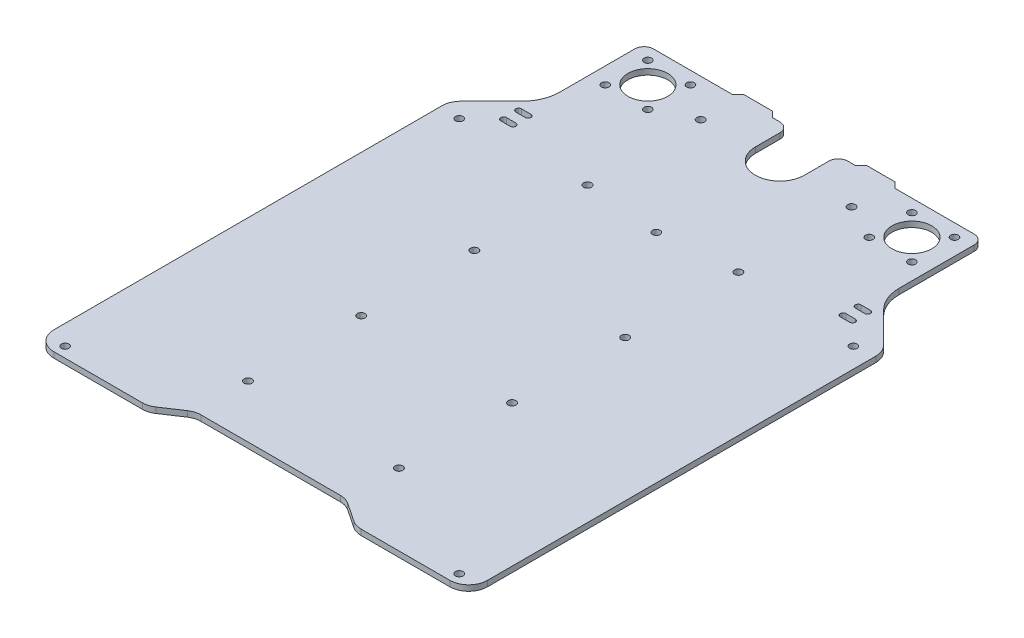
ISO-10303-21;
HEADER;
FILE_DESCRIPTION(('STEP AP214'),'2;1');
FILE_NAME('part.step','',(''),(''),'','','');
FILE_SCHEMA(('AUTOMOTIVE_DESIGN { 1 0 10303 214 1 1 1 1 }'));
ENDSEC;
DATA;
#1=APPLICATION_CONTEXT('core data for automotive mechanical design processes');
#2=APPLICATION_PROTOCOL_DEFINITION('international standard','automotive_design',2000,#1);
#3=PRODUCT_CONTEXT('',#1,'mechanical');
#4=PRODUCT('Part','Part','',(#3));
#5=PRODUCT_RELATED_PRODUCT_CATEGORY('part','',(#4));
#6=PRODUCT_DEFINITION_FORMATION('','',#4);
#7=PRODUCT_DEFINITION_CONTEXT('part definition',#1,'design');
#8=PRODUCT_DEFINITION('design','',#6,#7);
#9=PRODUCT_DEFINITION_SHAPE('','',#8);
#10=(LENGTH_UNIT() NAMED_UNIT(*) SI_UNIT(.MILLI.,.METRE.));
#11=(NAMED_UNIT(*) PLANE_ANGLE_UNIT() SI_UNIT($,.RADIAN.));
#12=(NAMED_UNIT(*) SI_UNIT($,.STERADIAN.) SOLID_ANGLE_UNIT());
#13=UNCERTAINTY_MEASURE_WITH_UNIT(LENGTH_MEASURE(1.E-05),#10,'distance_accuracy_value','');
#14=(GEOMETRIC_REPRESENTATION_CONTEXT(3) GLOBAL_UNCERTAINTY_ASSIGNED_CONTEXT((#13)) GLOBAL_UNIT_ASSIGNED_CONTEXT((#10,
#11,#12)) REPRESENTATION_CONTEXT('',''));
#15=CARTESIAN_POINT('',(0.,0.,0.));
#16=DIRECTION('',(0.,0.,1.));
#17=DIRECTION('',(1.,0.,0.));
#18=AXIS2_PLACEMENT_3D('',#15,#16,#17);
#19=CARTESIAN_POINT('',(22.,1.,-18.));
#20=DIRECTION('',(0.,0.,-1.));
#21=DIRECTION('',(-1.,0.,0.));
#22=AXIS2_PLACEMENT_3D('',#19,#20,#21);
#23=PLANE('',#22);
#24=DIRECTION('',(-1.,0.,0.));
#25=VECTOR('',#24,1.);
#26=CARTESIAN_POINT('',(22.,4.,-18.));
#27=LINE('',#26,#25);
#28=CARTESIAN_POINT('',(-18.,4.,-18.));
#29=VERTEX_POINT('',#28);
#30=CARTESIAN_POINT('',(-22.,4.,-18.));
#31=VERTEX_POINT('',#30);
#32=EDGE_CURVE('E787',#29,#31,#27,.T.);
#33=ORIENTED_EDGE('',*,*,#32,.F.);
#34=DIRECTION('',(0.,1.,0.));
#35=VECTOR('',#34,1.);
#36=CARTESIAN_POINT('',(-18.,1.,-18.));
#37=LINE('',#36,#35);
#38=CARTESIAN_POINT('',(-18.,1.,-18.));
#39=VERTEX_POINT('',#38);
#40=EDGE_CURVE('E878',#29,#39,#37,.F.);
#41=ORIENTED_EDGE('',*,*,#40,.T.);
#42=DIRECTION('',(-1.,0.,0.));
#43=VECTOR('',#42,1.);
#44=CARTESIAN_POINT('',(22.,1.,-18.));
#45=LINE('',#44,#43);
#46=CARTESIAN_POINT('',(-22.,1.,-18.));
#47=VERTEX_POINT('',#46);
#48=EDGE_CURVE('E715',#39,#47,#45,.T.);
#49=ORIENTED_EDGE('',*,*,#48,.T.);
#50=DIRECTION('',(0.,1.,0.));
#51=VECTOR('',#50,1.);
#52=CARTESIAN_POINT('',(-22.,1.,-18.));
#53=LINE('',#52,#51);
#54=EDGE_CURVE('E844',#47,#31,#53,.T.);
#55=ORIENTED_EDGE('',*,*,#54,.T.);
#56=EDGE_LOOP('',(#33,#41,#49,#55));
#57=FACE_BOUND('',#56,.T.);
#58=ADVANCED_FACE('F38',(#57),#23,.T.);
#59=CARTESIAN_POINT('',(55.,1.,280.));
#60=DIRECTION('',(0.,0.,1.));
#61=DIRECTION('',(1.,0.,0.));
#62=AXIS2_PLACEMENT_3D('',#59,#60,#61);
#63=PLANE('',#62);
#64=DIRECTION('',(1.,0.,0.));
#65=VECTOR('',#64,1.);
#66=CARTESIAN_POINT('',(55.,4.,280.));
#67=LINE('',#66,#65);
#68=CARTESIAN_POINT('',(58.02775637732,4.,280.));
#69=VERTEX_POINT('',#68);
#70=CARTESIAN_POINT('',(105.,4.,280.));
#71=VERTEX_POINT('',#70);
#72=EDGE_CURVE('E682',#69,#71,#67,.T.);
#73=ORIENTED_EDGE('',*,*,#72,.F.);
#74=DIRECTION('',(0.,1.,0.));
#75=VECTOR('',#74,1.);
#76=CARTESIAN_POINT('',(58.02775637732,1.,280.));
#77=LINE('',#76,#75);
#78=CARTESIAN_POINT('',(58.02775637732,1.,280.));
#79=VERTEX_POINT('',#78);
#80=EDGE_CURVE('E900',#69,#79,#77,.F.);
#81=ORIENTED_EDGE('',*,*,#80,.T.);
#82=DIRECTION('',(1.,0.,0.));
#83=VECTOR('',#82,1.);
#84=CARTESIAN_POINT('',(55.,1.,280.));
#85=LINE('',#84,#83);
#86=CARTESIAN_POINT('',(105.,1.,280.));
#87=VERTEX_POINT('',#86);
#88=EDGE_CURVE('E685',#79,#87,#85,.T.);
#89=ORIENTED_EDGE('',*,*,#88,.T.);
#90=DIRECTION('',(0.,1.,0.));
#91=VECTOR('',#90,1.);
#92=CARTESIAN_POINT('',(105.,1.,280.));
#93=LINE('',#92,#91);
#94=EDGE_CURVE('E897',#87,#71,#93,.T.);
#95=ORIENTED_EDGE('',*,*,#94,.T.);
#96=EDGE_LOOP('',(#73,#81,#89,#95));
#97=FACE_BOUND('',#96,.T.);
#98=ADVANCED_FACE('F1099',(#97),#63,.T.);
#99=CARTESIAN_POINT('',(55.,1.,280.));
#100=DIRECTION('',(-0.55470019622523,0.,0.832050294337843));
#101=DIRECTION('',(0.832050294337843,0.,0.55470019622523));
#102=AXIS2_PLACEMENT_3D('',#99,#100,#101);
#103=PLANE('',#102);
#104=DIRECTION('',(0.832050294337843,0.,0.55470019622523));
#105=VECTOR('',#104,1.);
#106=CARTESIAN_POINT('',(55.,1.,280.));
#107=LINE('',#106,#105);
#108=CARTESIAN_POINT('',(42.5192455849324,1.,271.679497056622));
#109=VERTEX_POINT('',#108);
#110=CARTESIAN_POINT('',(52.4807544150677,1.,278.320502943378));
#111=VERTEX_POINT('',#110);
#112=EDGE_CURVE('E755',#109,#111,#107,.T.);
#113=ORIENTED_EDGE('',*,*,#112,.T.);
#114=DIRECTION('',(0.,1.,0.));
#115=VECTOR('',#114,1.);
#116=CARTESIAN_POINT('',(52.4807544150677,1.,278.320502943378));
#117=LINE('',#116,#115);
#118=CARTESIAN_POINT('',(52.4807544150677,4.,278.320502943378));
#119=VERTEX_POINT('',#118);
#120=EDGE_CURVE('E882',#111,#119,#117,.T.);
#121=ORIENTED_EDGE('',*,*,#120,.T.);
#122=DIRECTION('',(0.832050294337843,0.,0.55470019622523));
#123=VECTOR('',#122,1.);
#124=CARTESIAN_POINT('',(55.,4.,280.));
#125=LINE('',#124,#123);
#126=CARTESIAN_POINT('',(42.5192455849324,4.,271.679497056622));
#127=VERTEX_POINT('',#126);
#128=EDGE_CURVE('E689',#127,#119,#125,.T.);
#129=ORIENTED_EDGE('',*,*,#128,.F.);
#130=DIRECTION('',(0.,1.,0.));
#131=VECTOR('',#130,1.);
#132=CARTESIAN_POINT('',(42.5192455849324,1.,271.679497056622));
#133=LINE('',#132,#131);
#134=EDGE_CURVE('E880',#127,#109,#133,.F.);
#135=ORIENTED_EDGE('',*,*,#134,.T.);
#136=EDGE_LOOP('',(#113,#121,#129,#135));
#137=FACE_BOUND('',#136,.T.);
#138=ADVANCED_FACE('F1108',(#137),#103,.T.);
#139=CARTESIAN_POINT('',(-40.,1.,270.));
#140=DIRECTION('',(0.,0.,1.));
#141=DIRECTION('',(1.,0.,0.));
#142=AXIS2_PLACEMENT_3D('',#139,#140,#141);
#143=PLANE('',#142);
#144=DIRECTION('',(1.,0.,0.));
#145=VECTOR('',#144,1.);
#146=CARTESIAN_POINT('',(-40.,1.,270.));
#147=LINE('',#146,#145);
#148=CARTESIAN_POINT('',(-36.97224362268,1.,270.));
#149=VERTEX_POINT('',#148);
#150=CARTESIAN_POINT('',(36.9722436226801,1.,270.));
#151=VERTEX_POINT('',#150);
#152=EDGE_CURVE('E752',#149,#151,#147,.T.);
#153=ORIENTED_EDGE('',*,*,#152,.T.);
#154=DIRECTION('',(0.,1.,0.));
#155=VECTOR('',#154,1.);
#156=CARTESIAN_POINT('',(36.9722436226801,4.,270.));
#157=LINE('',#156,#155);
#158=CARTESIAN_POINT('',(36.9722436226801,4.,270.));
#159=VERTEX_POINT('',#158);
#160=EDGE_CURVE('E916',#151,#159,#157,.T.);
#161=ORIENTED_EDGE('',*,*,#160,.T.);
#162=DIRECTION('',(1.,0.,0.));
#163=VECTOR('',#162,1.);
#164=CARTESIAN_POINT('',(-40.,4.,270.));
#165=LINE('',#164,#163);
#166=CARTESIAN_POINT('',(-36.97224362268,4.,270.));
#167=VERTEX_POINT('',#166);
#168=EDGE_CURVE('E824',#167,#159,#165,.T.);
#169=ORIENTED_EDGE('',*,*,#168,.F.);
#170=DIRECTION('',(0.,1.,0.));
#171=VECTOR('',#170,1.);
#172=CARTESIAN_POINT('',(-36.97224362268,1.,270.));
#173=LINE('',#172,#171);
#174=EDGE_CURVE('E914',#167,#149,#173,.F.);
#175=ORIENTED_EDGE('',*,*,#174,.T.);
#176=EDGE_LOOP('',(#153,#161,#169,#175));
#177=FACE_BOUND('',#176,.T.);
#178=ADVANCED_FACE('F956',(#177),#143,.T.);
#179=CARTESIAN_POINT('',(-55.,1.,280.));
#180=DIRECTION('',(0.55470019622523,0.,0.832050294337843));
#181=DIRECTION('',(0.832050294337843,0.,-0.55470019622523));
#182=AXIS2_PLACEMENT_3D('',#179,#180,#181);
#183=PLANE('',#182);
#184=DIRECTION('',(0.832050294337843,0.,-0.55470019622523));
#185=VECTOR('',#184,1.);
#186=CARTESIAN_POINT('',(-55.,1.,280.));
#187=LINE('',#186,#185);
#188=CARTESIAN_POINT('',(-52.4807544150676,1.,278.320502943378));
#189=VERTEX_POINT('',#188);
#190=CARTESIAN_POINT('',(-42.5192455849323,1.,271.679497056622));
#191=VERTEX_POINT('',#190);
#192=EDGE_CURVE('E749',#189,#191,#187,.T.);
#193=ORIENTED_EDGE('',*,*,#192,.T.);
#194=DIRECTION('',(0.,1.,0.));
#195=VECTOR('',#194,1.);
#196=CARTESIAN_POINT('',(-42.5192455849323,4.,271.679497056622));
#197=LINE('',#196,#195);
#198=CARTESIAN_POINT('',(-42.5192455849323,4.,271.679497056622));
#199=VERTEX_POINT('',#198);
#200=EDGE_CURVE('E921',#191,#199,#197,.T.);
#201=ORIENTED_EDGE('',*,*,#200,.T.);
#202=DIRECTION('',(0.832050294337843,0.,-0.55470019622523));
#203=VECTOR('',#202,1.);
#204=CARTESIAN_POINT('',(-55.,4.,280.));
#205=LINE('',#204,#203);
#206=CARTESIAN_POINT('',(-52.4807544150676,4.,278.320502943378));
#207=VERTEX_POINT('',#206);
#208=EDGE_CURVE('E821',#207,#199,#205,.T.);
#209=ORIENTED_EDGE('',*,*,#208,.F.);
#210=DIRECTION('',(0.,1.,0.));
#211=VECTOR('',#210,1.);
#212=CARTESIAN_POINT('',(-52.4807544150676,1.,278.320502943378));
#213=LINE('',#212,#211);
#214=EDGE_CURVE('E919',#207,#189,#213,.F.);
#215=ORIENTED_EDGE('',*,*,#214,.T.);
#216=EDGE_LOOP('',(#193,#201,#209,#215));
#217=FACE_BOUND('',#216,.T.);
#218=ADVANCED_FACE('F966',(#217),#183,.T.);
#219=CARTESIAN_POINT('',(-115.,1.,280.));
#220=DIRECTION('',(0.,0.,1.));
#221=DIRECTION('',(1.,0.,0.));
#222=AXIS2_PLACEMENT_3D('',#219,#220,#221);
#223=PLANE('',#222);
#224=DIRECTION('',(1.,0.,0.));
#225=VECTOR('',#224,1.);
#226=CARTESIAN_POINT('',(-115.,1.,280.));
#227=LINE('',#226,#225);
#228=CARTESIAN_POINT('',(-105.,1.,280.));
#229=VERTEX_POINT('',#228);
#230=CARTESIAN_POINT('',(-58.0277563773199,1.,280.));
#231=VERTEX_POINT('',#230);
#232=EDGE_CURVE('E746',#229,#231,#227,.T.);
#233=ORIENTED_EDGE('',*,*,#232,.T.);
#234=DIRECTION('',(0.,1.,0.));
#235=VECTOR('',#234,1.);
#236=CARTESIAN_POINT('',(-58.0277563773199,1.,280.));
#237=LINE('',#236,#235);
#238=CARTESIAN_POINT('',(-58.0277563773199,4.,280.));
#239=VERTEX_POINT('',#238);
#240=EDGE_CURVE('E926',#231,#239,#237,.T.);
#241=ORIENTED_EDGE('',*,*,#240,.T.);
#242=DIRECTION('',(1.,0.,0.));
#243=VECTOR('',#242,1.);
#244=CARTESIAN_POINT('',(-115.,4.,280.));
#245=LINE('',#244,#243);
#246=CARTESIAN_POINT('',(-105.,4.,280.));
#247=VERTEX_POINT('',#246);
#248=EDGE_CURVE('E818',#247,#239,#245,.T.);
#249=ORIENTED_EDGE('',*,*,#248,.F.);
#250=DIRECTION('',(0.,1.,0.));
#251=VECTOR('',#250,1.);
#252=CARTESIAN_POINT('',(-105.,1.,280.));
#253=LINE('',#252,#251);
#254=EDGE_CURVE('E924',#247,#229,#253,.F.);
#255=ORIENTED_EDGE('',*,*,#254,.T.);
#256=EDGE_LOOP('',(#233,#241,#249,#255));
#257=FACE_BOUND('',#256,.T.);
#258=ADVANCED_FACE('F974',(#257),#223,.T.);
#259=CARTESIAN_POINT('',(-115.,1.,60.));
#260=DIRECTION('',(-1.,0.,0.));
#261=DIRECTION('',(0.,0.,1.));
#262=AXIS2_PLACEMENT_3D('',#259,#260,#261);
#263=PLANE('',#262);
#264=DIRECTION('',(0.,0.,1.));
#265=VECTOR('',#264,1.);
#266=CARTESIAN_POINT('',(-115.,1.,60.));
#267=LINE('',#266,#265);
#268=CARTESIAN_POINT('',(-115.,1.,64.142135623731));
#269=VERTEX_POINT('',#268);
#270=CARTESIAN_POINT('',(-115.,1.,270.));
#271=VERTEX_POINT('',#270);
#272=EDGE_CURVE('E743',#269,#271,#267,.T.);
#273=ORIENTED_EDGE('',*,*,#272,.T.);
#274=DIRECTION('',(0.,1.,0.));
#275=VECTOR('',#274,1.);
#276=CARTESIAN_POINT('',(-115.,1.,270.));
#277=LINE('',#276,#275);
#278=CARTESIAN_POINT('',(-115.,4.,270.));
#279=VERTEX_POINT('',#278);
#280=EDGE_CURVE('E938',#271,#279,#277,.T.);
#281=ORIENTED_EDGE('',*,*,#280,.T.);
#282=DIRECTION('',(0.,0.,1.));
#283=VECTOR('',#282,1.);
#284=CARTESIAN_POINT('',(-115.,4.,60.));
#285=LINE('',#284,#283);
#286=CARTESIAN_POINT('',(-115.,4.,64.142135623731));
#287=VERTEX_POINT('',#286);
#288=EDGE_CURVE('E815',#287,#279,#285,.T.);
#289=ORIENTED_EDGE('',*,*,#288,.F.);
#290=DIRECTION('',(0.,1.,0.));
#291=VECTOR('',#290,1.);
#292=CARTESIAN_POINT('',(-115.,1.,64.142135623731));
#293=LINE('',#292,#291);
#294=EDGE_CURVE('E936',#287,#269,#293,.F.);
#295=ORIENTED_EDGE('',*,*,#294,.T.);
#296=EDGE_LOOP('',(#273,#281,#289,#295));
#297=FACE_BOUND('',#296,.T.);
#298=ADVANCED_FACE('F983',(#297),#263,.T.);
#299=CARTESIAN_POINT('',(-95.8578643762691,1.,40.8578643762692));
#300=DIRECTION('',(-0.707106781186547,0.,-0.707106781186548));
#301=DIRECTION('',(-0.707106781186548,0.,0.707106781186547));
#302=AXIS2_PLACEMENT_3D('',#299,#300,#301);
#303=PLANE('',#302);
#304=DIRECTION('',(-0.707106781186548,0.,0.707106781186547));
#305=VECTOR('',#304,1.);
#306=CARTESIAN_POINT('',(-95.8578643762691,1.,40.8578643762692));
#307=LINE('',#306,#305);
#308=CARTESIAN_POINT('',(-95.8578643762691,1.,40.8578643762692));
#309=VERTEX_POINT('',#308);
#310=CARTESIAN_POINT('',(-112.071067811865,1.,57.0710678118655));
#311=VERTEX_POINT('',#310);
#312=EDGE_CURVE('E740',#309,#311,#307,.T.);
#313=ORIENTED_EDGE('',*,*,#312,.T.);
#314=DIRECTION('',(0.,1.,0.));
#315=VECTOR('',#314,1.);
#316=CARTESIAN_POINT('',(-112.071067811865,1.,57.0710678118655));
#317=LINE('',#316,#315);
#318=CARTESIAN_POINT('',(-112.071067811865,4.,57.0710678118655));
#319=VERTEX_POINT('',#318);
#320=EDGE_CURVE('E941',#311,#319,#317,.T.);
#321=ORIENTED_EDGE('',*,*,#320,.T.);
#322=DIRECTION('',(-0.707106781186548,0.,0.707106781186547));
#323=VECTOR('',#322,1.);
#324=CARTESIAN_POINT('',(-95.8578643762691,4.,40.8578643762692));
#325=LINE('',#324,#323);
#326=CARTESIAN_POINT('',(-95.8578643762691,4.,40.8578643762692));
#327=VERTEX_POINT('',#326);
#328=EDGE_CURVE('E812',#327,#319,#325,.T.);
#329=ORIENTED_EDGE('',*,*,#328,.F.);
#330=DIRECTION('',(0.,1.,0.));
#331=VECTOR('',#330,1.);
#332=CARTESIAN_POINT('',(-95.8578643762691,1.,40.8578643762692));
#333=LINE('',#332,#331);
#334=EDGE_CURVE('E829',#309,#327,#333,.T.);
#335=ORIENTED_EDGE('',*,*,#334,.F.);
#336=EDGE_LOOP('',(#313,#321,#329,#335));
#337=FACE_BOUND('',#336,.T.);
#338=ADVANCED_FACE('F991',(#337),#303,.T.);
#339=CARTESIAN_POINT('',(-110.,1.,26.7157287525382));
#340=DIRECTION('',(0.,1.,0.));
#341=DIRECTION('',(0.,0.,1.));
#342=AXIS2_PLACEMENT_3D('',#339,#340,#341);
#343=CYLINDRICAL_SURFACE('',#342,20.);
#344=CARTESIAN_POINT('',(-110.,4.,26.7157287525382));
#345=DIRECTION('',(0.,-1.,0.));
#346=DIRECTION('',(0.,0.,1.));
#347=AXIS2_PLACEMENT_3D('',#344,#345,#346);
#348=CIRCLE('',#347,20.);
#349=CARTESIAN_POINT('',(-90.,4.,26.7157287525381));
#350=VERTEX_POINT('',#349);
#351=EDGE_CURVE('E809',#350,#327,#348,.T.);
#352=ORIENTED_EDGE('',*,*,#351,.F.);
#353=DIRECTION('',(0.,1.,0.));
#354=VECTOR('',#353,1.);
#355=CARTESIAN_POINT('',(-90.,1.,26.7157287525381));
#356=LINE('',#355,#354);
#357=CARTESIAN_POINT('',(-90.,1.,26.7157287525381));
#358=VERTEX_POINT('',#357);
#359=EDGE_CURVE('E832',#358,#350,#356,.T.);
#360=ORIENTED_EDGE('',*,*,#359,.F.);
#361=CARTESIAN_POINT('',(-110.,1.,26.7157287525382));
#362=DIRECTION('',(0.,-1.,0.));
#363=DIRECTION('',(0.,0.,1.));
#364=AXIS2_PLACEMENT_3D('',#361,#362,#363);
#365=CIRCLE('',#364,20.);
#366=EDGE_CURVE('E737',#358,#309,#365,.T.);
#367=ORIENTED_EDGE('',*,*,#366,.T.);
#368=ORIENTED_EDGE('',*,*,#334,.T.);
#369=EDGE_LOOP('',(#352,#360,#367,#368));
#370=FACE_BOUND('',#369,.T.);
#371=ADVANCED_FACE('F995',(#370),#343,.F.);
#372=CARTESIAN_POINT('',(-90.,1.,-12.9999999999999));
#373=DIRECTION('',(-1.,0.,0.));
#374=DIRECTION('',(0.,0.,1.));
#375=AXIS2_PLACEMENT_3D('',#372,#373,#374);
#376=PLANE('',#375);
#377=DIRECTION('',(0.,0.,1.));
#378=VECTOR('',#377,1.);
#379=CARTESIAN_POINT('',(-90.,4.,-12.9999999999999));
#380=LINE('',#379,#378);
#381=CARTESIAN_POINT('',(-90.,4.,-12.9999999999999));
#382=VERTEX_POINT('',#381);
#383=EDGE_CURVE('E806',#382,#350,#380,.T.);
#384=ORIENTED_EDGE('',*,*,#383,.F.);
#385=DIRECTION('',(0.,1.,0.));
#386=VECTOR('',#385,1.);
#387=CARTESIAN_POINT('',(-90.,1.,-12.9999999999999));
#388=LINE('',#387,#386);
#389=CARTESIAN_POINT('',(-90.,1.,-12.9999999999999));
#390=VERTEX_POINT('',#389);
#391=EDGE_CURVE('E834',#390,#382,#388,.T.);
#392=ORIENTED_EDGE('',*,*,#391,.F.);
#393=DIRECTION('',(0.,0.,1.));
#394=VECTOR('',#393,1.);
#395=CARTESIAN_POINT('',(-90.,1.,-12.9999999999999));
#396=LINE('',#395,#394);
#397=EDGE_CURVE('E734',#390,#358,#396,.T.);
#398=ORIENTED_EDGE('',*,*,#397,.T.);
#399=ORIENTED_EDGE('',*,*,#359,.T.);
#400=EDGE_LOOP('',(#384,#392,#398,#399));
#401=FACE_BOUND('',#400,.T.);
#402=ADVANCED_FACE('F1000',(#401),#376,.T.);
#403=CARTESIAN_POINT('',(-85.,1.,-13.));
#404=DIRECTION('',(0.,1.,0.));
#405=DIRECTION('',(0.,0.,1.));
#406=AXIS2_PLACEMENT_3D('',#403,#404,#405);
#407=CYLINDRICAL_SURFACE('',#406,5.);
#408=CARTESIAN_POINT('',(-85.,4.,-13.));
#409=DIRECTION('',(0.,1.,0.));
#410=DIRECTION('',(0.,0.,-1.));
#411=AXIS2_PLACEMENT_3D('',#408,#409,#410);
#412=CIRCLE('',#411,5.);
#413=CARTESIAN_POINT('',(-85.,4.,-18.));
#414=VERTEX_POINT('',#413);
#415=EDGE_CURVE('E803',#414,#382,#412,.T.);
#416=ORIENTED_EDGE('',*,*,#415,.F.);
#417=DIRECTION('',(0.,1.,0.));
#418=VECTOR('',#417,1.);
#419=CARTESIAN_POINT('',(-85.,1.,-18.));
#420=LINE('',#419,#418);
#421=CARTESIAN_POINT('',(-85.,1.,-18.));
#422=VERTEX_POINT('',#421);
#423=EDGE_CURVE('E836',#422,#414,#420,.T.);
#424=ORIENTED_EDGE('',*,*,#423,.F.);
#425=CARTESIAN_POINT('',(-85.,1.,-13.));
#426=DIRECTION('',(0.,1.,0.));
#427=DIRECTION('',(0.,0.,-1.));
#428=AXIS2_PLACEMENT_3D('',#425,#426,#427);
#429=CIRCLE('',#428,5.);
#430=EDGE_CURVE('E731',#422,#390,#429,.T.);
#431=ORIENTED_EDGE('',*,*,#430,.T.);
#432=ORIENTED_EDGE('',*,*,#391,.T.);
#433=EDGE_LOOP('',(#416,#424,#431,#432));
#434=FACE_BOUND('',#433,.T.);
#435=ADVANCED_FACE('F1003',(#434),#407,.T.);
#436=CARTESIAN_POINT('',(-43.,1.,-18.));
#437=DIRECTION('',(0.,0.,-1.));
#438=DIRECTION('',(-1.,0.,0.));
#439=AXIS2_PLACEMENT_3D('',#436,#437,#438);
#440=PLANE('',#439);
#441=DIRECTION('',(-1.,0.,0.));
#442=VECTOR('',#441,1.);
#443=CARTESIAN_POINT('',(-43.,4.,-18.));
#444=LINE('',#443,#442);
#445=CARTESIAN_POINT('',(-43.,4.,-18.));
#446=VERTEX_POINT('',#445);
#447=EDGE_CURVE('E800',#446,#414,#444,.T.);
#448=ORIENTED_EDGE('',*,*,#447,.F.);
#449=DIRECTION('',(0.,1.,0.));
#450=VECTOR('',#449,1.);
#451=CARTESIAN_POINT('',(-43.,1.,-18.));
#452=LINE('',#451,#450);
#453=CARTESIAN_POINT('',(-43.,1.,-18.));
#454=VERTEX_POINT('',#453);
#455=EDGE_CURVE('E838',#454,#446,#452,.T.);
#456=ORIENTED_EDGE('',*,*,#455,.F.);
#457=DIRECTION('',(-1.,0.,0.));
#458=VECTOR('',#457,1.);
#459=CARTESIAN_POINT('',(-43.,1.,-18.));
#460=LINE('',#459,#458);
#461=EDGE_CURVE('E728',#454,#422,#460,.T.);
#462=ORIENTED_EDGE('',*,*,#461,.T.);
#463=ORIENTED_EDGE('',*,*,#423,.T.);
#464=EDGE_LOOP('',(#448,#456,#462,#463));
#465=FACE_BOUND('',#464,.T.);
#466=ADVANCED_FACE('F1008',(#465),#440,.T.);
#467=CARTESIAN_POINT('',(-43.,1.,-18.));
#468=DIRECTION('',(-0.707106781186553,0.,-0.707106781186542));
#469=DIRECTION('',(-0.707106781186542,0.,0.707106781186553));
#470=AXIS2_PLACEMENT_3D('',#467,#468,#469);
#471=PLANE('',#470);
#472=DIRECTION('',(-0.707106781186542,0.,0.707106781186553));
#473=VECTOR('',#472,1.);
#474=CARTESIAN_POINT('',(-43.,4.,-18.));
#475=LINE('',#474,#473);
#476=CARTESIAN_POINT('',(-40.,4.,-21.));
#477=VERTEX_POINT('',#476);
#478=EDGE_CURVE('E797',#477,#446,#475,.T.);
#479=ORIENTED_EDGE('',*,*,#478,.F.);
#480=DIRECTION('',(0.,1.,0.));
#481=VECTOR('',#480,1.);
#482=CARTESIAN_POINT('',(-40.,1.,-21.));
#483=LINE('',#482,#481);
#484=CARTESIAN_POINT('',(-40.,1.,-21.));
#485=VERTEX_POINT('',#484);
#486=EDGE_CURVE('E840',#485,#477,#483,.T.);
#487=ORIENTED_EDGE('',*,*,#486,.F.);
#488=DIRECTION('',(-0.707106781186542,0.,0.707106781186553));
#489=VECTOR('',#488,1.);
#490=CARTESIAN_POINT('',(-43.,1.,-18.));
#491=LINE('',#490,#489);
#492=EDGE_CURVE('E725',#485,#454,#491,.T.);
#493=ORIENTED_EDGE('',*,*,#492,.T.);
#494=ORIENTED_EDGE('',*,*,#455,.T.);
#495=EDGE_LOOP('',(#479,#487,#493,#494));
#496=FACE_BOUND('',#495,.T.);
#497=ADVANCED_FACE('F1011',(#496),#471,.T.);
#498=CARTESIAN_POINT('',(-40.,1.,-21.));
#499=DIRECTION('',(0.,0.,-1.));
#500=DIRECTION('',(-1.,0.,0.));
#501=AXIS2_PLACEMENT_3D('',#498,#499,#500);
#502=PLANE('',#501);
#503=DIRECTION('',(-1.,0.,0.));
#504=VECTOR('',#503,1.);
#505=CARTESIAN_POINT('',(-40.,4.,-21.));
#506=LINE('',#505,#504);
#507=CARTESIAN_POINT('',(-25.,4.,-21.));
#508=VERTEX_POINT('',#507);
#509=EDGE_CURVE('E794',#508,#477,#506,.T.);
#510=ORIENTED_EDGE('',*,*,#509,.F.);
#511=DIRECTION('',(0.,1.,0.));
#512=VECTOR('',#511,1.);
#513=CARTESIAN_POINT('',(-25.,1.,-21.));
#514=LINE('',#513,#512);
#515=CARTESIAN_POINT('',(-25.,1.,-21.));
#516=VERTEX_POINT('',#515);
#517=EDGE_CURVE('E842',#516,#508,#514,.T.);
#518=ORIENTED_EDGE('',*,*,#517,.F.);
#519=DIRECTION('',(-1.,0.,0.));
#520=VECTOR('',#519,1.);
#521=CARTESIAN_POINT('',(-40.,1.,-21.));
#522=LINE('',#521,#520);
#523=EDGE_CURVE('E722',#516,#485,#522,.T.);
#524=ORIENTED_EDGE('',*,*,#523,.T.);
#525=ORIENTED_EDGE('',*,*,#486,.T.);
#526=EDGE_LOOP('',(#510,#518,#524,#525));
#527=FACE_BOUND('',#526,.T.);
#528=ADVANCED_FACE('F1016',(#527),#502,.T.);
#529=CARTESIAN_POINT('',(-25.,1.,-21.));
#530=DIRECTION('',(0.707106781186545,0.,-0.70710678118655));
#531=DIRECTION('',(-0.70710678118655,0.,-0.707106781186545));
#532=AXIS2_PLACEMENT_3D('',#529,#530,#531);
#533=PLANE('',#532);
#534=DIRECTION('',(-0.70710678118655,0.,-0.707106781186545));
#535=VECTOR('',#534,1.);
#536=CARTESIAN_POINT('',(-25.,4.,-21.));
#537=LINE('',#536,#535);
#538=EDGE_CURVE('E791',#31,#508,#537,.T.);
#539=ORIENTED_EDGE('',*,*,#538,.F.);
#540=ORIENTED_EDGE('',*,*,#54,.F.);
#541=DIRECTION('',(-0.70710678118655,0.,-0.707106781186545));
#542=VECTOR('',#541,1.);
#543=CARTESIAN_POINT('',(-25.,1.,-21.));
#544=LINE('',#543,#542);
#545=EDGE_CURVE('E719',#47,#516,#544,.T.);
#546=ORIENTED_EDGE('',*,*,#545,.T.);
#547=ORIENTED_EDGE('',*,*,#517,.T.);
#548=EDGE_LOOP('',(#539,#540,#546,#547));
#549=FACE_BOUND('',#548,.T.);
#550=ADVANCED_FACE('F1019',(#549),#533,.T.);
#551=CARTESIAN_POINT('',(22.,1.,-18.));
#552=VERTEX_POINT('',#551);
#553=CARTESIAN_POINT('',(18.,1.,-18.));
#554=VERTEX_POINT('',#553);
#555=EDGE_CURVE('E716',#552,#554,#45,.T.);
#556=ORIENTED_EDGE('',*,*,#555,.T.);
#557=DIRECTION('',(0.,1.,0.));
#558=VECTOR('',#557,1.);
#559=CARTESIAN_POINT('',(18.,4.,-18.));
#560=LINE('',#559,#558);
#561=CARTESIAN_POINT('',(18.,4.,-18.));
#562=VERTEX_POINT('',#561);
#563=EDGE_CURVE('E831',#554,#562,#560,.T.);
#564=ORIENTED_EDGE('',*,*,#563,.T.);
#565=CARTESIAN_POINT('',(22.,4.,-18.));
#566=VERTEX_POINT('',#565);
#567=EDGE_CURVE('E788',#566,#562,#27,.T.);
#568=ORIENTED_EDGE('',*,*,#567,.F.);
#569=DIRECTION('',(0.,1.,0.));
#570=VECTOR('',#569,1.);
#571=CARTESIAN_POINT('',(22.,1.,-18.));
#572=LINE('',#571,#570);
#573=EDGE_CURVE('E847',#552,#566,#572,.T.);
#574=ORIENTED_EDGE('',*,*,#573,.F.);
#575=EDGE_LOOP('',(#556,#564,#568,#574));
#576=FACE_BOUND('',#575,.T.);
#577=ADVANCED_FACE('F1050',(#576),#23,.T.);
#578=CARTESIAN_POINT('',(25.,1.,-21.));
#579=DIRECTION('',(-0.707106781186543,0.,-0.707106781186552));
#580=DIRECTION('',(-0.707106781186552,0.,0.707106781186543));
#581=AXIS2_PLACEMENT_3D('',#578,#579,#580);
#582=PLANE('',#581);
#583=DIRECTION('',(-0.707106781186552,0.,0.707106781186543));
#584=VECTOR('',#583,1.);
#585=CARTESIAN_POINT('',(25.,4.,-21.));
#586=LINE('',#585,#584);
#587=CARTESIAN_POINT('',(25.,4.,-21.));
#588=VERTEX_POINT('',#587);
#589=EDGE_CURVE('E784',#588,#566,#586,.T.);
#590=ORIENTED_EDGE('',*,*,#589,.F.);
#591=DIRECTION('',(0.,1.,0.));
#592=VECTOR('',#591,1.);
#593=CARTESIAN_POINT('',(25.,1.,-21.));
#594=LINE('',#593,#592);
#595=CARTESIAN_POINT('',(25.,1.,-21.));
#596=VERTEX_POINT('',#595);
#597=EDGE_CURVE('E849',#596,#588,#594,.T.);
#598=ORIENTED_EDGE('',*,*,#597,.F.);
#599=DIRECTION('',(-0.707106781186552,0.,0.707106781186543));
#600=VECTOR('',#599,1.);
#601=CARTESIAN_POINT('',(25.,1.,-21.));
#602=LINE('',#601,#600);
#603=EDGE_CURVE('E712',#596,#552,#602,.T.);
#604=ORIENTED_EDGE('',*,*,#603,.T.);
#605=ORIENTED_EDGE('',*,*,#573,.T.);
#606=EDGE_LOOP('',(#590,#598,#604,#605));
#607=FACE_BOUND('',#606,.T.);
#608=ADVANCED_FACE('F1054',(#607),#582,.T.);
#609=CARTESIAN_POINT('',(40.,1.,-21.));
#610=DIRECTION('',(0.,0.,-1.));
#611=DIRECTION('',(-1.,0.,0.));
#612=AXIS2_PLACEMENT_3D('',#609,#610,#611);
#613=PLANE('',#612);
#614=DIRECTION('',(-1.,0.,0.));
#615=VECTOR('',#614,1.);
#616=CARTESIAN_POINT('',(40.,4.,-21.));
#617=LINE('',#616,#615);
#618=CARTESIAN_POINT('',(40.,4.,-21.));
#619=VERTEX_POINT('',#618);
#620=EDGE_CURVE('E781',#619,#588,#617,.T.);
#621=ORIENTED_EDGE('',*,*,#620,.F.);
#622=DIRECTION('',(0.,1.,0.));
#623=VECTOR('',#622,1.);
#624=CARTESIAN_POINT('',(40.,1.,-21.));
#625=LINE('',#624,#623);
#626=CARTESIAN_POINT('',(40.,1.,-21.));
#627=VERTEX_POINT('',#626);
#628=EDGE_CURVE('E851',#627,#619,#625,.T.);
#629=ORIENTED_EDGE('',*,*,#628,.F.);
#630=DIRECTION('',(-1.,0.,0.));
#631=VECTOR('',#630,1.);
#632=CARTESIAN_POINT('',(40.,1.,-21.));
#633=LINE('',#632,#631);
#634=EDGE_CURVE('E709',#627,#596,#633,.T.);
#635=ORIENTED_EDGE('',*,*,#634,.T.);
#636=ORIENTED_EDGE('',*,*,#597,.T.);
#637=EDGE_LOOP('',(#621,#629,#635,#636));
#638=FACE_BOUND('',#637,.T.);
#639=ADVANCED_FACE('F1059',(#638),#613,.T.);
#640=CARTESIAN_POINT('',(43.,1.,-18.));
#641=DIRECTION('',(0.70710678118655,0.,-0.707106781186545));
#642=DIRECTION('',(-0.707106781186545,0.,-0.70710678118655));
#643=AXIS2_PLACEMENT_3D('',#640,#641,#642);
#644=PLANE('',#643);
#645=DIRECTION('',(-0.707106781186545,0.,-0.70710678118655));
#646=VECTOR('',#645,1.);
#647=CARTESIAN_POINT('',(43.,4.,-18.));
#648=LINE('',#647,#646);
#649=CARTESIAN_POINT('',(43.,4.,-18.));
#650=VERTEX_POINT('',#649);
#651=EDGE_CURVE('E778',#650,#619,#648,.T.);
#652=ORIENTED_EDGE('',*,*,#651,.F.);
#653=DIRECTION('',(0.,1.,0.));
#654=VECTOR('',#653,1.);
#655=CARTESIAN_POINT('',(43.,1.,-18.));
#656=LINE('',#655,#654);
#657=CARTESIAN_POINT('',(43.,1.,-18.));
#658=VERTEX_POINT('',#657);
#659=EDGE_CURVE('E853',#658,#650,#656,.T.);
#660=ORIENTED_EDGE('',*,*,#659,.F.);
#661=DIRECTION('',(-0.707106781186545,0.,-0.70710678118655));
#662=VECTOR('',#661,1.);
#663=CARTESIAN_POINT('',(43.,1.,-18.));
#664=LINE('',#663,#662);
#665=EDGE_CURVE('E706',#658,#627,#664,.T.);
#666=ORIENTED_EDGE('',*,*,#665,.T.);
#667=ORIENTED_EDGE('',*,*,#628,.T.);
#668=EDGE_LOOP('',(#652,#660,#666,#667));
#669=FACE_BOUND('',#668,.T.);
#670=ADVANCED_FACE('F1062',(#669),#644,.T.);
#671=CARTESIAN_POINT('',(85.,1.,-18.));
#672=DIRECTION('',(0.,0.,-1.));
#673=DIRECTION('',(-1.,0.,0.));
#674=AXIS2_PLACEMENT_3D('',#671,#672,#673);
#675=PLANE('',#674);
#676=DIRECTION('',(-1.,0.,0.));
#677=VECTOR('',#676,1.);
#678=CARTESIAN_POINT('',(85.,4.,-18.));
#679=LINE('',#678,#677);
#680=CARTESIAN_POINT('',(85.,4.,-18.));
#681=VERTEX_POINT('',#680);
#682=EDGE_CURVE('E775',#681,#650,#679,.T.);
#683=ORIENTED_EDGE('',*,*,#682,.F.);
#684=DIRECTION('',(0.,1.,0.));
#685=VECTOR('',#684,1.);
#686=CARTESIAN_POINT('',(85.,1.,-18.));
#687=LINE('',#686,#685);
#688=CARTESIAN_POINT('',(85.,1.,-18.));
#689=VERTEX_POINT('',#688);
#690=EDGE_CURVE('E855',#689,#681,#687,.T.);
#691=ORIENTED_EDGE('',*,*,#690,.F.);
#692=DIRECTION('',(-1.,0.,0.));
#693=VECTOR('',#692,1.);
#694=CARTESIAN_POINT('',(85.,1.,-18.));
#695=LINE('',#694,#693);
#696=EDGE_CURVE('E703',#689,#658,#695,.T.);
#697=ORIENTED_EDGE('',*,*,#696,.T.);
#698=ORIENTED_EDGE('',*,*,#659,.T.);
#699=EDGE_LOOP('',(#683,#691,#697,#698));
#700=FACE_BOUND('',#699,.T.);
#701=ADVANCED_FACE('F1067',(#700),#675,.T.);
#702=CARTESIAN_POINT('',(85.,1.,-13.));
#703=DIRECTION('',(0.,1.,0.));
#704=DIRECTION('',(0.,0.,1.));
#705=AXIS2_PLACEMENT_3D('',#702,#703,#704);
#706=CYLINDRICAL_SURFACE('',#705,5.);
#707=CARTESIAN_POINT('',(85.,4.,-13.));
#708=DIRECTION('',(0.,1.,0.));
#709=DIRECTION('',(0.,0.,1.));
#710=AXIS2_PLACEMENT_3D('',#707,#708,#709);
#711=CIRCLE('',#710,5.);
#712=CARTESIAN_POINT('',(90.,4.,-13.));
#713=VERTEX_POINT('',#712);
#714=EDGE_CURVE('E772',#713,#681,#711,.T.);
#715=ORIENTED_EDGE('',*,*,#714,.F.);
#716=DIRECTION('',(0.,1.,0.));
#717=VECTOR('',#716,1.);
#718=CARTESIAN_POINT('',(90.,1.,-13.));
#719=LINE('',#718,#717);
#720=CARTESIAN_POINT('',(90.,1.,-13.));
#721=VERTEX_POINT('',#720);
#722=EDGE_CURVE('E857',#721,#713,#719,.T.);
#723=ORIENTED_EDGE('',*,*,#722,.F.);
#724=CARTESIAN_POINT('',(85.,1.,-13.));
#725=DIRECTION('',(0.,1.,0.));
#726=DIRECTION('',(0.,0.,1.));
#727=AXIS2_PLACEMENT_3D('',#724,#725,#726);
#728=CIRCLE('',#727,5.);
#729=EDGE_CURVE('E700',#721,#689,#728,.T.);
#730=ORIENTED_EDGE('',*,*,#729,.T.);
#731=ORIENTED_EDGE('',*,*,#690,.T.);
#732=EDGE_LOOP('',(#715,#723,#730,#731));
#733=FACE_BOUND('',#732,.T.);
#734=ADVANCED_FACE('F1070',(#733),#706,.T.);
#735=CARTESIAN_POINT('',(90.,1.,-13.));
#736=DIRECTION('',(1.,0.,0.));
#737=DIRECTION('',(0.,0.,-1.));
#738=AXIS2_PLACEMENT_3D('',#735,#736,#737);
#739=PLANE('',#738);
#740=DIRECTION('',(0.,0.,-1.));
#741=VECTOR('',#740,1.);
#742=CARTESIAN_POINT('',(90.,4.,-13.));
#743=LINE('',#742,#741);
#744=CARTESIAN_POINT('',(90.,4.,26.7157287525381));
#745=VERTEX_POINT('',#744);
#746=EDGE_CURVE('E769',#745,#713,#743,.T.);
#747=ORIENTED_EDGE('',*,*,#746,.F.);
#748=DIRECTION('',(0.,1.,0.));
#749=VECTOR('',#748,1.);
#750=CARTESIAN_POINT('',(90.,1.,26.7157287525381));
#751=LINE('',#750,#749);
#752=CARTESIAN_POINT('',(90.,1.,26.7157287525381));
#753=VERTEX_POINT('',#752);
#754=EDGE_CURVE('E859',#753,#745,#751,.T.);
#755=ORIENTED_EDGE('',*,*,#754,.F.);
#756=DIRECTION('',(0.,0.,-1.));
#757=VECTOR('',#756,1.);
#758=CARTESIAN_POINT('',(90.,1.,-13.));
#759=LINE('',#758,#757);
#760=EDGE_CURVE('E697',#753,#721,#759,.T.);
#761=ORIENTED_EDGE('',*,*,#760,.T.);
#762=ORIENTED_EDGE('',*,*,#722,.T.);
#763=EDGE_LOOP('',(#747,#755,#761,#762));
#764=FACE_BOUND('',#763,.T.);
#765=ADVANCED_FACE('F1075',(#764),#739,.T.);
#766=CARTESIAN_POINT('',(110.,1.,26.7157287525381));
#767=DIRECTION('',(0.,1.,0.));
#768=DIRECTION('',(0.,0.,1.));
#769=AXIS2_PLACEMENT_3D('',#766,#767,#768);
#770=CYLINDRICAL_SURFACE('',#769,20.);
#771=CARTESIAN_POINT('',(110.,4.,26.7157287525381));
#772=DIRECTION('',(0.,-1.,0.));
#773=DIRECTION('',(0.,0.,1.));
#774=AXIS2_PLACEMENT_3D('',#771,#772,#773);
#775=CIRCLE('',#774,20.);
#776=CARTESIAN_POINT('',(95.8578643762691,4.,40.8578643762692));
#777=VERTEX_POINT('',#776);
#778=EDGE_CURVE('E766',#777,#745,#775,.T.);
#779=ORIENTED_EDGE('',*,*,#778,.F.);
#780=DIRECTION('',(0.,1.,0.));
#781=VECTOR('',#780,1.);
#782=CARTESIAN_POINT('',(95.8578643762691,1.,40.8578643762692));
#783=LINE('',#782,#781);
#784=CARTESIAN_POINT('',(95.8578643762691,1.,40.8578643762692));
#785=VERTEX_POINT('',#784);
#786=EDGE_CURVE('E758',#785,#777,#783,.T.);
#787=ORIENTED_EDGE('',*,*,#786,.F.);
#788=CARTESIAN_POINT('',(110.,1.,26.7157287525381));
#789=DIRECTION('',(0.,-1.,0.));
#790=DIRECTION('',(0.,0.,1.));
#791=AXIS2_PLACEMENT_3D('',#788,#789,#790);
#792=CIRCLE('',#791,20.);
#793=EDGE_CURVE('E694',#785,#753,#792,.T.);
#794=ORIENTED_EDGE('',*,*,#793,.T.);
#795=ORIENTED_EDGE('',*,*,#754,.T.);
#796=EDGE_LOOP('',(#779,#787,#794,#795));
#797=FACE_BOUND('',#796,.T.);
#798=ADVANCED_FACE('F1078',(#797),#770,.F.);
#799=CARTESIAN_POINT('',(95.8578643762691,1.,40.8578643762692));
#800=DIRECTION('',(0.707106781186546,0.,-0.707106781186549));
#801=DIRECTION('',(-0.707106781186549,0.,-0.707106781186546));
#802=AXIS2_PLACEMENT_3D('',#799,#800,#801);
#803=PLANE('',#802);
#804=DIRECTION('',(-0.707106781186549,0.,-0.707106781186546));
#805=VECTOR('',#804,1.);
#806=CARTESIAN_POINT('',(95.8578643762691,4.,40.8578643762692));
#807=LINE('',#806,#805);
#808=CARTESIAN_POINT('',(112.071067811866,4.,57.0710678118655));
#809=VERTEX_POINT('',#808);
#810=EDGE_CURVE('E764',#809,#777,#807,.T.);
#811=ORIENTED_EDGE('',*,*,#810,.F.);
#812=DIRECTION('',(0.,1.,0.));
#813=VECTOR('',#812,1.);
#814=CARTESIAN_POINT('',(112.071067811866,1.,57.0710678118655));
#815=LINE('',#814,#813);
#816=CARTESIAN_POINT('',(112.071067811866,1.,57.0710678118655));
#817=VERTEX_POINT('',#816);
#818=EDGE_CURVE('E934',#809,#817,#815,.F.);
#819=ORIENTED_EDGE('',*,*,#818,.T.);
#820=DIRECTION('',(-0.707106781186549,0.,-0.707106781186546));
#821=VECTOR('',#820,1.);
#822=CARTESIAN_POINT('',(95.8578643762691,1.,40.8578643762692));
#823=LINE('',#822,#821);
#824=EDGE_CURVE('E692',#817,#785,#823,.T.);
#825=ORIENTED_EDGE('',*,*,#824,.T.);
#826=ORIENTED_EDGE('',*,*,#786,.T.);
#827=EDGE_LOOP('',(#811,#819,#825,#826));
#828=FACE_BOUND('',#827,.T.);
#829=ADVANCED_FACE('F1875',(#828),#803,.T.);
#830=CARTESIAN_POINT('',(115.,1.,60.));
#831=DIRECTION('',(1.,0.,0.));
#832=DIRECTION('',(0.,0.,-1.));
#833=AXIS2_PLACEMENT_3D('',#830,#831,#832);
#834=PLANE('',#833);
#835=DIRECTION('',(0.,0.,-1.));
#836=VECTOR('',#835,1.);
#837=CARTESIAN_POINT('',(115.,1.,60.));
#838=LINE('',#837,#836);
#839=CARTESIAN_POINT('',(115.,1.,270.));
#840=VERTEX_POINT('',#839);
#841=CARTESIAN_POINT('',(115.,1.,64.142135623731));
#842=VERTEX_POINT('',#841);
#843=EDGE_CURVE('E688',#840,#842,#838,.T.);
#844=ORIENTED_EDGE('',*,*,#843,.T.);
#845=DIRECTION('',(0.,1.,0.));
#846=VECTOR('',#845,1.);
#847=CARTESIAN_POINT('',(115.,1.,64.142135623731));
#848=LINE('',#847,#846);
#849=CARTESIAN_POINT('',(115.,4.,64.142135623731));
#850=VERTEX_POINT('',#849);
#851=EDGE_CURVE('E931',#842,#850,#848,.T.);
#852=ORIENTED_EDGE('',*,*,#851,.T.);
#853=DIRECTION('',(0.,0.,-1.));
#854=VECTOR('',#853,1.);
#855=CARTESIAN_POINT('',(115.,4.,60.));
#856=LINE('',#855,#854);
#857=CARTESIAN_POINT('',(115.,4.,270.));
#858=VERTEX_POINT('',#857);
#859=EDGE_CURVE('E761',#858,#850,#856,.T.);
#860=ORIENTED_EDGE('',*,*,#859,.F.);
#861=DIRECTION('',(0.,1.,0.));
#862=VECTOR('',#861,1.);
#863=CARTESIAN_POINT('',(115.,1.,270.));
#864=LINE('',#863,#862);
#865=EDGE_CURVE('E929',#858,#840,#864,.F.);
#866=ORIENTED_EDGE('',*,*,#865,.T.);
#867=EDGE_LOOP('',(#844,#852,#860,#866));
#868=FACE_BOUND('',#867,.T.);
#869=ADVANCED_FACE('F1090',(#868),#834,.T.);
#870=CARTESIAN_POINT('',(110.,1.,26.7157287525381));
#871=DIRECTION('',(0.,1.,0.));
#872=DIRECTION('',(0.,0.,1.));
#873=AXIS2_PLACEMENT_3D('',#870,#871,#872);
#874=PLANE('',#873);
#875=DIRECTION('',(1.,0.,0.));
#876=VECTOR('',#875,1.);
#877=CARTESIAN_POINT('',(-87.5,1.,47.5));
#878=LINE('',#877,#876);
#879=CARTESIAN_POINT('',(-92.5,1.,47.5));
#880=VERTEX_POINT('',#879);
#881=CARTESIAN_POINT('',(-87.5,1.,47.5));
#882=VERTEX_POINT('',#881);
#883=EDGE_CURVE('E461',#880,#882,#878,.T.);
#884=ORIENTED_EDGE('',*,*,#883,.T.);
#885=CARTESIAN_POINT('',(-87.5,1.,46.));
#886=DIRECTION('',(0.,1.,0.));
#887=DIRECTION('',(0.,0.,-1.));
#888=AXIS2_PLACEMENT_3D('',#885,#886,#887);
#889=CIRCLE('',#888,1.5);
#890=CARTESIAN_POINT('',(-87.5,1.,44.5));
#891=VERTEX_POINT('',#890);
#892=EDGE_CURVE('E453',#882,#891,#889,.T.);
#893=ORIENTED_EDGE('',*,*,#892,.T.);
#894=DIRECTION('',(-1.,0.,0.));
#895=VECTOR('',#894,1.);
#896=CARTESIAN_POINT('',(-87.5,1.,44.5));
#897=LINE('',#896,#895);
#898=CARTESIAN_POINT('',(-92.5,1.,44.5));
#899=VERTEX_POINT('',#898);
#900=EDGE_CURVE('E456',#891,#899,#897,.T.);
#901=ORIENTED_EDGE('',*,*,#900,.T.);
#902=CARTESIAN_POINT('',(-92.5,1.,46.));
#903=DIRECTION('',(0.,1.,0.));
#904=DIRECTION('',(0.,0.,-1.));
#905=AXIS2_PLACEMENT_3D('',#902,#903,#904);
#906=CIRCLE('',#905,1.5);
#907=EDGE_CURVE('E53',#899,#880,#906,.T.);
#908=ORIENTED_EDGE('',*,*,#907,.T.);
#909=EDGE_LOOP('',(#884,#893,#901,#908));
#910=FACE_BOUND('',#909,.T.);
#911=DIRECTION('',(1.,0.,0.));
#912=VECTOR('',#911,1.);
#913=CARTESIAN_POINT('',(-87.5,1.,55.5));
#914=LINE('',#913,#912);
#915=CARTESIAN_POINT('',(-92.5,1.,55.5));
#916=VERTEX_POINT('',#915);
#917=CARTESIAN_POINT('',(-87.5,1.,55.5));
#918=VERTEX_POINT('',#917);
#919=EDGE_CURVE('E431',#916,#918,#914,.T.);
#920=ORIENTED_EDGE('',*,*,#919,.T.);
#921=CARTESIAN_POINT('',(-87.5,1.,54.));
#922=DIRECTION('',(0.,1.,0.));
#923=DIRECTION('',(0.,0.,1.));
#924=AXIS2_PLACEMENT_3D('',#921,#922,#923);
#925=CIRCLE('',#924,1.5);
#926=CARTESIAN_POINT('',(-87.5,1.,52.5));
#927=VERTEX_POINT('',#926);
#928=EDGE_CURVE('E423',#918,#927,#925,.T.);
#929=ORIENTED_EDGE('',*,*,#928,.T.);
#930=DIRECTION('',(-1.,0.,0.));
#931=VECTOR('',#930,1.);
#932=CARTESIAN_POINT('',(-87.5,1.,52.5));
#933=LINE('',#932,#931);
#934=CARTESIAN_POINT('',(-92.5,1.,52.5));
#935=VERTEX_POINT('',#934);
#936=EDGE_CURVE('E426',#927,#935,#933,.T.);
#937=ORIENTED_EDGE('',*,*,#936,.T.);
#938=CARTESIAN_POINT('',(-92.5,1.,54.));
#939=DIRECTION('',(0.,1.,0.));
#940=DIRECTION('',(0.,0.,1.));
#941=AXIS2_PLACEMENT_3D('',#938,#939,#940);
#942=CIRCLE('',#941,1.5);
#943=EDGE_CURVE('E61',#935,#916,#942,.T.);
#944=ORIENTED_EDGE('',*,*,#943,.T.);
#945=EDGE_LOOP('',(#920,#929,#937,#944));
#946=FACE_BOUND('',#945,.T.);
#947=DIRECTION('',(-1.,0.,0.));
#948=VECTOR('',#947,1.);
#949=CARTESIAN_POINT('',(87.5,1.,52.5));
#950=LINE('',#949,#948);
#951=CARTESIAN_POINT('',(92.5,1.,52.5));
#952=VERTEX_POINT('',#951);
#953=CARTESIAN_POINT('',(87.5,1.,52.5));
#954=VERTEX_POINT('',#953);
#955=EDGE_CURVE('E390',#952,#954,#950,.T.);
#956=ORIENTED_EDGE('',*,*,#955,.T.);
#957=CARTESIAN_POINT('',(87.5,1.,54.));
#958=DIRECTION('',(0.,1.,0.));
#959=DIRECTION('',(0.,0.,-1.));
#960=AXIS2_PLACEMENT_3D('',#957,#958,#959);
#961=CIRCLE('',#960,1.49999999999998);
#962=CARTESIAN_POINT('',(87.5,1.,55.5));
#963=VERTEX_POINT('',#962);
#964=EDGE_CURVE('E382',#954,#963,#961,.T.);
#965=ORIENTED_EDGE('',*,*,#964,.T.);
#966=DIRECTION('',(1.,0.,0.));
#967=VECTOR('',#966,1.);
#968=CARTESIAN_POINT('',(87.5,1.,55.5));
#969=LINE('',#968,#967);
#970=CARTESIAN_POINT('',(92.5,1.,55.5));
#971=VERTEX_POINT('',#970);
#972=EDGE_CURVE('E394',#963,#971,#969,.T.);
#973=ORIENTED_EDGE('',*,*,#972,.T.);
#974=CARTESIAN_POINT('',(92.5,1.,54.));
#975=DIRECTION('',(0.,1.,0.));
#976=DIRECTION('',(0.,0.,-1.));
#977=AXIS2_PLACEMENT_3D('',#974,#975,#976);
#978=CIRCLE('',#977,1.49999999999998);
#979=EDGE_CURVE('E398',#971,#952,#978,.T.);
#980=ORIENTED_EDGE('',*,*,#979,.T.);
#981=EDGE_LOOP('',(#956,#965,#973,#980));
#982=FACE_BOUND('',#981,.T.);
#983=DIRECTION('',(-1.,0.,0.));
#984=VECTOR('',#983,1.);
#985=CARTESIAN_POINT('',(87.5,1.,44.5));
#986=LINE('',#985,#984);
#987=CARTESIAN_POINT('',(92.5,1.,44.5));
#988=VERTEX_POINT('',#987);
#989=CARTESIAN_POINT('',(87.5,1.,44.5));
#990=VERTEX_POINT('',#989);
#991=EDGE_CURVE('E492',#988,#990,#986,.T.);
#992=ORIENTED_EDGE('',*,*,#991,.T.);
#993=CARTESIAN_POINT('',(87.5,1.,46.));
#994=DIRECTION('',(0.,1.,0.));
#995=DIRECTION('',(0.,0.,1.));
#996=AXIS2_PLACEMENT_3D('',#993,#994,#995);
#997=CIRCLE('',#996,1.49999999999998);
#998=CARTESIAN_POINT('',(87.5,1.,47.5));
#999=VERTEX_POINT('',#998);
#1000=EDGE_CURVE('E482',#990,#999,#997,.T.);
#1001=ORIENTED_EDGE('',*,*,#1000,.T.);
#1002=DIRECTION('',(1.,0.,0.));
#1003=VECTOR('',#1002,1.);
#1004=CARTESIAN_POINT('',(87.5,1.,47.5));
#1005=LINE('',#1004,#1003);
#1006=CARTESIAN_POINT('',(92.5,1.,47.5));
#1007=VERTEX_POINT('',#1006);
#1008=EDGE_CURVE('E485',#999,#1007,#1005,.T.);
#1009=ORIENTED_EDGE('',*,*,#1008,.T.);
#1010=CARTESIAN_POINT('',(92.5,1.,46.));
#1011=DIRECTION('',(0.,1.,0.));
#1012=DIRECTION('',(0.,0.,1.));
#1013=AXIS2_PLACEMENT_3D('',#1010,#1011,#1012);
#1014=CIRCLE('',#1013,1.49999999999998);
#1015=EDGE_CURVE('E489',#1007,#988,#1014,.T.);
#1016=ORIENTED_EDGE('',*,*,#1015,.T.);
#1017=EDGE_LOOP('',(#992,#1001,#1009,#1016));
#1018=FACE_BOUND('',#1017,.T.);
#1019=CARTESIAN_POINT('',(40.0000000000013,1.,122.));
#1020=DIRECTION('',(0.,1.,0.));
#1021=DIRECTION('',(0.,0.,1.));
#1022=AXIS2_PLACEMENT_3D('',#1019,#1020,#1021);
#1023=CIRCLE('',#1022,2.05);
#1024=CARTESIAN_POINT('',(40.0000000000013,1.,124.05));
#1025=VERTEX_POINT('',#1024);
#1026=EDGE_CURVE('E539',#1025,#1025,#1023,.T.);
#1027=ORIENTED_EDGE('',*,*,#1026,.T.);
#1028=EDGE_LOOP('',(#1027));
#1029=FACE_BOUND('',#1028,.T.);
#1030=CARTESIAN_POINT('',(40.0000000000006,1.,62.));
#1031=DIRECTION('',(0.,1.,0.));
#1032=DIRECTION('',(0.,0.,1.));
#1033=AXIS2_PLACEMENT_3D('',#1030,#1031,#1032);
#1034=CIRCLE('',#1033,2.05);
#1035=CARTESIAN_POINT('',(40.0000000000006,1.,64.05));
#1036=VERTEX_POINT('',#1035);
#1037=EDGE_CURVE('E533',#1036,#1036,#1034,.T.);
#1038=ORIENTED_EDGE('',*,*,#1037,.T.);
#1039=EDGE_LOOP('',(#1038));
#1040=FACE_BOUND('',#1039,.T.);
#1041=CARTESIAN_POINT('',(-40.,1.,2.00000000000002));
#1042=DIRECTION('',(0.,1.,0.));
#1043=DIRECTION('',(0.,0.,-1.));
#1044=AXIS2_PLACEMENT_3D('',#1041,#1042,#1043);
#1045=CIRCLE('',#1044,2.04999999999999);
#1046=CARTESIAN_POINT('',(-40.,1.,-0.049999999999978));
#1047=VERTEX_POINT('',#1046);
#1048=EDGE_CURVE('E527',#1047,#1047,#1045,.T.);
#1049=ORIENTED_EDGE('',*,*,#1048,.T.);
#1050=EDGE_LOOP('',(#1049));
#1051=FACE_BOUND('',#1050,.T.);
#1052=CARTESIAN_POINT('',(-40.0000000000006,1.,62.));
#1053=DIRECTION('',(0.,1.,0.));
#1054=DIRECTION('',(0.,0.,-1.));
#1055=AXIS2_PLACEMENT_3D('',#1052,#1053,#1054);
#1056=CIRCLE('',#1055,2.05);
#1057=CARTESIAN_POINT('',(-40.0000000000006,1.,59.95));
#1058=VERTEX_POINT('',#1057);
#1059=EDGE_CURVE('E520',#1058,#1058,#1056,.T.);
#1060=ORIENTED_EDGE('',*,*,#1059,.T.);
#1061=EDGE_LOOP('',(#1060));
#1062=FACE_BOUND('',#1061,.T.);
#1063=CARTESIAN_POINT('',(-40.0000000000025,1.,242.));
#1064=DIRECTION('',(0.,1.,0.));
#1065=DIRECTION('',(0.,0.,-1.));
#1066=AXIS2_PLACEMENT_3D('',#1063,#1064,#1065);
#1067=CIRCLE('',#1066,2.04999999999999);
#1068=CARTESIAN_POINT('',(-40.0000000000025,1.,239.95));
#1069=VERTEX_POINT('',#1068);
#1070=EDGE_CURVE('E556',#1069,#1069,#1067,.T.);
#1071=ORIENTED_EDGE('',*,*,#1070,.T.);
#1072=EDGE_LOOP('',(#1071));
#1073=FACE_BOUND('',#1072,.T.);
#1074=CARTESIAN_POINT('',(40.,1.,2.00000000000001));
#1075=DIRECTION('',(0.,1.,0.));
#1076=DIRECTION('',(0.,0.,1.));
#1077=AXIS2_PLACEMENT_3D('',#1074,#1075,#1076);
#1078=CIRCLE('',#1077,2.04999999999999);
#1079=CARTESIAN_POINT('',(40.,1.,4.05));
#1080=VERTEX_POINT('',#1079);
#1081=EDGE_CURVE('E563',#1080,#1080,#1078,.T.);
#1082=ORIENTED_EDGE('',*,*,#1081,.T.);
#1083=EDGE_LOOP('',(#1082));
#1084=FACE_BOUND('',#1083,.T.);
#1085=CARTESIAN_POINT('',(-40.0000000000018,1.,182.));
#1086=DIRECTION('',(0.,1.,0.));
#1087=DIRECTION('',(0.,0.,-1.));
#1088=AXIS2_PLACEMENT_3D('',#1085,#1086,#1087);
#1089=CIRCLE('',#1088,2.04999999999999);
#1090=CARTESIAN_POINT('',(-40.0000000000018,1.,179.95));
#1091=VERTEX_POINT('',#1090);
#1092=EDGE_CURVE('E544',#1091,#1091,#1089,.T.);
#1093=ORIENTED_EDGE('',*,*,#1092,.T.);
#1094=EDGE_LOOP('',(#1093));
#1095=FACE_BOUND('',#1094,.T.);
#1096=CARTESIAN_POINT('',(-40.0000000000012,1.,122.));
#1097=DIRECTION('',(0.,1.,0.));
#1098=DIRECTION('',(0.,0.,-1.));
#1099=AXIS2_PLACEMENT_3D('',#1096,#1097,#1098);
#1100=CIRCLE('',#1099,2.05);
#1101=CARTESIAN_POINT('',(-40.0000000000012,1.,119.95));
#1102=VERTEX_POINT('',#1101);
#1103=EDGE_CURVE('E551',#1102,#1102,#1100,.T.);
#1104=ORIENTED_EDGE('',*,*,#1103,.T.);
#1105=EDGE_LOOP('',(#1104));
#1106=FACE_BOUND('',#1105,.T.);
#1107=CARTESIAN_POINT('',(40.0000000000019,1.,182.));
#1108=DIRECTION('',(0.,1.,0.));
#1109=DIRECTION('',(0.,0.,1.));
#1110=AXIS2_PLACEMENT_3D('',#1107,#1108,#1109);
#1111=CIRCLE('',#1110,2.04999999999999);
#1112=CARTESIAN_POINT('',(40.0000000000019,1.,184.05));
#1113=VERTEX_POINT('',#1112);
#1114=EDGE_CURVE('E514',#1113,#1113,#1111,.T.);
#1115=ORIENTED_EDGE('',*,*,#1114,.T.);
#1116=EDGE_LOOP('',(#1115));
#1117=FACE_BOUND('',#1116,.T.);
#1118=CARTESIAN_POINT('',(40.0000000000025,1.,242.));
#1119=DIRECTION('',(0.,1.,0.));
#1120=DIRECTION('',(0.,0.,1.));
#1121=AXIS2_PLACEMENT_3D('',#1118,#1119,#1120);
#1122=CIRCLE('',#1121,2.04999999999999);
#1123=CARTESIAN_POINT('',(40.0000000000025,1.,244.05));
#1124=VERTEX_POINT('',#1123);
#1125=EDGE_CURVE('E568',#1124,#1124,#1122,.T.);
#1126=ORIENTED_EDGE('',*,*,#1125,.T.);
#1127=EDGE_LOOP('',(#1126));
#1128=FACE_BOUND('',#1127,.T.);
#1129=CARTESIAN_POINT('',(-104.5,1.,65.5));
#1130=DIRECTION('',(0.,1.,0.));
#1131=DIRECTION('',(0.,0.,1.));
#1132=AXIS2_PLACEMENT_3D('',#1129,#1130,#1131);
#1133=CIRCLE('',#1132,2.);
#1134=CARTESIAN_POINT('',(-104.5,1.,67.5));
#1135=VERTEX_POINT('',#1134);
#1136=EDGE_CURVE('E595',#1135,#1135,#1133,.T.);
#1137=ORIENTED_EDGE('',*,*,#1136,.T.);
#1138=EDGE_LOOP('',(#1137));
#1139=FACE_BOUND('',#1138,.T.);
#1140=CARTESIAN_POINT('',(-104.5,1.,274.5));
#1141=DIRECTION('',(0.,1.,0.));
#1142=DIRECTION('',(0.,0.,-1.));
#1143=AXIS2_PLACEMENT_3D('',#1140,#1141,#1142);
#1144=CIRCLE('',#1143,2.);
#1145=CARTESIAN_POINT('',(-104.5,1.,272.5));
#1146=VERTEX_POINT('',#1145);
#1147=EDGE_CURVE('E601',#1146,#1146,#1144,.T.);
#1148=ORIENTED_EDGE('',*,*,#1147,.T.);
#1149=EDGE_LOOP('',(#1148));
#1150=FACE_BOUND('',#1149,.T.);
#1151=CARTESIAN_POINT('',(58.6999999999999,1.,11.3));
#1152=DIRECTION('',(0.,1.,0.));
#1153=DIRECTION('',(0.,0.,1.));
#1154=AXIS2_PLACEMENT_3D('',#1151,#1152,#1153);
#1155=CIRCLE('',#1154,2.);
#1156=CARTESIAN_POINT('',(58.6999999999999,1.,13.3));
#1157=VERTEX_POINT('',#1156);
#1158=EDGE_CURVE('E607',#1157,#1157,#1155,.T.);
#1159=ORIENTED_EDGE('',*,*,#1158,.T.);
#1160=EDGE_LOOP('',(#1159));
#1161=FACE_BOUND('',#1160,.T.);
#1162=CARTESIAN_POINT('',(81.2999999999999,1.,-11.3));
#1163=DIRECTION('',(0.,1.,0.));
#1164=DIRECTION('',(0.,0.,1.));
#1165=AXIS2_PLACEMENT_3D('',#1162,#1163,#1164);
#1166=CIRCLE('',#1165,2.);
#1167=CARTESIAN_POINT('',(81.2999999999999,1.,-9.3));
#1168=VERTEX_POINT('',#1167);
#1169=EDGE_CURVE('E613',#1168,#1168,#1166,.T.);
#1170=ORIENTED_EDGE('',*,*,#1169,.T.);
#1171=EDGE_LOOP('',(#1170));
#1172=FACE_BOUND('',#1171,.T.);
#1173=CARTESIAN_POINT('',(104.5,1.,65.5));
#1174=DIRECTION('',(0.,1.,0.));
#1175=DIRECTION('',(0.,0.,-1.));
#1176=AXIS2_PLACEMENT_3D('',#1173,#1174,#1175);
#1177=CIRCLE('',#1176,2.);
#1178=CARTESIAN_POINT('',(104.5,1.,63.5));
#1179=VERTEX_POINT('',#1178);
#1180=EDGE_CURVE('E619',#1179,#1179,#1177,.T.);
#1181=ORIENTED_EDGE('',*,*,#1180,.T.);
#1182=EDGE_LOOP('',(#1181));
#1183=FACE_BOUND('',#1182,.T.);
#1184=CARTESIAN_POINT('',(70.,1.,0.));
#1185=DIRECTION('',(0.,1.,0.));
#1186=DIRECTION('',(0.,0.,1.));
#1187=AXIS2_PLACEMENT_3D('',#1184,#1185,#1186);
#1188=CIRCLE('',#1187,10.55);
#1189=CARTESIAN_POINT('',(70.,1.,10.55));
#1190=VERTEX_POINT('',#1189);
#1191=EDGE_CURVE('E625',#1190,#1190,#1188,.T.);
#1192=ORIENTED_EDGE('',*,*,#1191,.T.);
#1193=EDGE_LOOP('',(#1192));
#1194=FACE_BOUND('',#1193,.T.);
#1195=CARTESIAN_POINT('',(0.,1.,65.5));
#1196=DIRECTION('',(0.,1.,0.));
#1197=DIRECTION('',(0.,0.,-1.));
#1198=AXIS2_PLACEMENT_3D('',#1195,#1196,#1197);
#1199=CIRCLE('',#1198,2.);
#1200=CARTESIAN_POINT('',(0.,1.,63.5));
#1201=VERTEX_POINT('',#1200);
#1202=EDGE_CURVE('E631',#1201,#1201,#1199,.T.);
#1203=ORIENTED_EDGE('',*,*,#1202,.T.);
#1204=EDGE_LOOP('',(#1203));
#1205=FACE_BOUND('',#1204,.T.);
#1206=CARTESIAN_POINT('',(104.5,1.,274.5));
#1207=DIRECTION('',(0.,1.,0.));
#1208=DIRECTION('',(0.,0.,1.));
#1209=AXIS2_PLACEMENT_3D('',#1206,#1207,#1208);
#1210=CIRCLE('',#1209,2.);
#1211=CARTESIAN_POINT('',(104.5,1.,276.5));
#1212=VERTEX_POINT('',#1211);
#1213=EDGE_CURVE('E637',#1212,#1212,#1210,.T.);
#1214=ORIENTED_EDGE('',*,*,#1213,.T.);
#1215=EDGE_LOOP('',(#1214));
#1216=FACE_BOUND('',#1215,.T.);
#1217=CARTESIAN_POINT('',(58.6999999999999,1.,-11.3));
#1218=DIRECTION('',(0.,1.,0.));
#1219=DIRECTION('',(0.,0.,1.));
#1220=AXIS2_PLACEMENT_3D('',#1217,#1218,#1219);
#1221=CIRCLE('',#1220,2.);
#1222=CARTESIAN_POINT('',(58.6999999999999,1.,-9.3));
#1223=VERTEX_POINT('',#1222);
#1224=EDGE_CURVE('E643',#1223,#1223,#1221,.T.);
#1225=ORIENTED_EDGE('',*,*,#1224,.T.);
#1226=EDGE_LOOP('',(#1225));
#1227=FACE_BOUND('',#1226,.T.);
#1228=CARTESIAN_POINT('',(81.2999999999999,1.,11.3));
#1229=DIRECTION('',(0.,1.,0.));
#1230=DIRECTION('',(0.,0.,1.));
#1231=AXIS2_PLACEMENT_3D('',#1228,#1229,#1230);
#1232=CIRCLE('',#1231,2.);
#1233=CARTESIAN_POINT('',(81.2999999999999,1.,13.3));
#1234=VERTEX_POINT('',#1233);
#1235=EDGE_CURVE('E649',#1234,#1234,#1232,.T.);
#1236=ORIENTED_EDGE('',*,*,#1235,.T.);
#1237=EDGE_LOOP('',(#1236));
#1238=FACE_BOUND('',#1237,.T.);
#1239=CARTESIAN_POINT('',(-81.2999999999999,1.,11.3));
#1240=DIRECTION('',(0.,1.,0.));
#1241=DIRECTION('',(0.,0.,-1.));
#1242=AXIS2_PLACEMENT_3D('',#1239,#1240,#1241);
#1243=CIRCLE('',#1242,2.);
#1244=CARTESIAN_POINT('',(-81.2999999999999,1.,9.30000000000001));
#1245=VERTEX_POINT('',#1244);
#1246=EDGE_CURVE('E655',#1245,#1245,#1243,.T.);
#1247=ORIENTED_EDGE('',*,*,#1246,.T.);
#1248=EDGE_LOOP('',(#1247));
#1249=FACE_BOUND('',#1248,.T.);
#1250=CARTESIAN_POINT('',(-58.6999999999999,1.,-11.3));
#1251=DIRECTION('',(0.,1.,0.));
#1252=DIRECTION('',(0.,0.,-1.));
#1253=AXIS2_PLACEMENT_3D('',#1250,#1251,#1252);
#1254=CIRCLE('',#1253,2.);
#1255=CARTESIAN_POINT('',(-58.6999999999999,1.,-13.3));
#1256=VERTEX_POINT('',#1255);
#1257=EDGE_CURVE('E661',#1256,#1256,#1254,.T.);
#1258=ORIENTED_EDGE('',*,*,#1257,.T.);
#1259=EDGE_LOOP('',(#1258));
#1260=FACE_BOUND('',#1259,.T.);
#1261=CARTESIAN_POINT('',(-70.,1.,0.));
#1262=DIRECTION('',(0.,1.,0.));
#1263=DIRECTION('',(0.,0.,-1.));
#1264=AXIS2_PLACEMENT_3D('',#1261,#1262,#1263);
#1265=CIRCLE('',#1264,10.55);
#1266=CARTESIAN_POINT('',(-70.,1.,-10.55));
#1267=VERTEX_POINT('',#1266);
#1268=EDGE_CURVE('E667',#1267,#1267,#1265,.T.);
#1269=ORIENTED_EDGE('',*,*,#1268,.T.);
#1270=EDGE_LOOP('',(#1269));
#1271=FACE_BOUND('',#1270,.T.);
#1272=CARTESIAN_POINT('',(-81.2999999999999,1.,-11.3));
#1273=DIRECTION('',(0.,1.,0.));
#1274=DIRECTION('',(0.,0.,-1.));
#1275=AXIS2_PLACEMENT_3D('',#1272,#1273,#1274);
#1276=CIRCLE('',#1275,2.);
#1277=CARTESIAN_POINT('',(-81.2999999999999,1.,-13.3));
#1278=VERTEX_POINT('',#1277);
#1279=EDGE_CURVE('E673',#1278,#1278,#1276,.T.);
#1280=ORIENTED_EDGE('',*,*,#1279,.T.);
#1281=EDGE_LOOP('',(#1280));
#1282=FACE_BOUND('',#1281,.T.);
#1283=CARTESIAN_POINT('',(-58.6999999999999,1.,11.3));
#1284=DIRECTION('',(0.,1.,0.));
#1285=DIRECTION('',(0.,0.,-1.));
#1286=AXIS2_PLACEMENT_3D('',#1283,#1284,#1285);
#1287=CIRCLE('',#1286,2.);
#1288=CARTESIAN_POINT('',(-58.6999999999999,1.,9.3));
#1289=VERTEX_POINT('',#1288);
#1290=EDGE_CURVE('E679',#1289,#1289,#1287,.T.);
#1291=ORIENTED_EDGE('',*,*,#1290,.T.);
#1292=EDGE_LOOP('',(#1291));
#1293=FACE_BOUND('',#1292,.T.);
#1294=ORIENTED_EDGE('',*,*,#88,.F.);
#1295=CARTESIAN_POINT('',(58.02775637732,1.,270.));
#1296=DIRECTION('',(0.,1.,0.));
#1297=DIRECTION('',(0.,0.,1.));
#1298=AXIS2_PLACEMENT_3D('',#1295,#1296,#1297);
#1299=CIRCLE('',#1298,10.);
#1300=EDGE_CURVE('E912',#79,#111,#1299,.F.);
#1301=ORIENTED_EDGE('',*,*,#1300,.T.);
#1302=ORIENTED_EDGE('',*,*,#112,.F.);
#1303=CARTESIAN_POINT('',(36.9722436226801,1.,280.));
#1304=DIRECTION('',(0.,1.,0.));
#1305=DIRECTION('',(0.,0.,1.));
#1306=AXIS2_PLACEMENT_3D('',#1303,#1304,#1305);
#1307=CIRCLE('',#1306,10.);
#1308=EDGE_CURVE('E946',#109,#151,#1307,.T.);
#1309=ORIENTED_EDGE('',*,*,#1308,.T.);
#1310=ORIENTED_EDGE('',*,*,#152,.F.);
#1311=CARTESIAN_POINT('',(-36.97224362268,1.,280.));
#1312=DIRECTION('',(0.,1.,0.));
#1313=DIRECTION('',(0.,0.,1.));
#1314=AXIS2_PLACEMENT_3D('',#1311,#1312,#1313);
#1315=CIRCLE('',#1314,10.);
#1316=EDGE_CURVE('E11',#149,#191,#1315,.T.);
#1317=ORIENTED_EDGE('',*,*,#1316,.T.);
#1318=ORIENTED_EDGE('',*,*,#192,.F.);
#1319=CARTESIAN_POINT('',(-58.0277563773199,1.,270.));
#1320=DIRECTION('',(0.,1.,0.));
#1321=DIRECTION('',(0.,0.,1.));
#1322=AXIS2_PLACEMENT_3D('',#1319,#1320,#1321);
#1323=CIRCLE('',#1322,10.);
#1324=EDGE_CURVE('E910',#189,#231,#1323,.F.);
#1325=ORIENTED_EDGE('',*,*,#1324,.T.);
#1326=ORIENTED_EDGE('',*,*,#232,.F.);
#1327=CARTESIAN_POINT('',(-105.,1.,270.));
#1328=DIRECTION('',(0.,1.,0.));
#1329=DIRECTION('',(0.,0.,1.));
#1330=AXIS2_PLACEMENT_3D('',#1327,#1328,#1329);
#1331=CIRCLE('',#1330,10.);
#1332=EDGE_CURVE('E904',#229,#271,#1331,.F.);
#1333=ORIENTED_EDGE('',*,*,#1332,.T.);
#1334=ORIENTED_EDGE('',*,*,#272,.F.);
#1335=CARTESIAN_POINT('',(-105.,1.,64.142135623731));
#1336=DIRECTION('',(0.,1.,0.));
#1337=DIRECTION('',(0.,0.,1.));
#1338=AXIS2_PLACEMENT_3D('',#1335,#1336,#1337);
#1339=CIRCLE('',#1338,10.);
#1340=EDGE_CURVE('E902',#269,#311,#1339,.F.);
#1341=ORIENTED_EDGE('',*,*,#1340,.T.);
#1342=ORIENTED_EDGE('',*,*,#312,.F.);
#1343=ORIENTED_EDGE('',*,*,#366,.F.);
#1344=ORIENTED_EDGE('',*,*,#397,.F.);
#1345=ORIENTED_EDGE('',*,*,#430,.F.);
#1346=ORIENTED_EDGE('',*,*,#461,.F.);
#1347=ORIENTED_EDGE('',*,*,#492,.F.);
#1348=ORIENTED_EDGE('',*,*,#523,.F.);
#1349=ORIENTED_EDGE('',*,*,#545,.F.);
#1350=ORIENTED_EDGE('',*,*,#48,.F.);
#1351=CARTESIAN_POINT('',(-18.,1.,-13.));
#1352=DIRECTION('',(0.,1.,0.));
#1353=DIRECTION('',(0.,0.,1.));
#1354=AXIS2_PLACEMENT_3D('',#1351,#1352,#1353);
#1355=CIRCLE('',#1354,5.);
#1356=CARTESIAN_POINT('',(-13.,1.,-13.));
#1357=VERTEX_POINT('',#1356);
#1358=EDGE_CURVE('E871',#39,#1357,#1355,.F.);
#1359=ORIENTED_EDGE('',*,*,#1358,.T.);
#1360=DIRECTION('',(0.,0.,1.));
#1361=VECTOR('',#1360,1.);
#1362=CARTESIAN_POINT('',(-13.,1.,0.));
#1363=LINE('',#1362,#1361);
#1364=CARTESIAN_POINT('',(-13.,1.,0.));
#1365=VERTEX_POINT('',#1364);
#1366=EDGE_CURVE('E581',#1357,#1365,#1363,.T.);
#1367=ORIENTED_EDGE('',*,*,#1366,.T.);
#1368=CARTESIAN_POINT('',(0.,1.,0.));
#1369=DIRECTION('',(0.,1.,0.));
#1370=DIRECTION('',(0.,0.,1.));
#1371=AXIS2_PLACEMENT_3D('',#1368,#1369,#1370);
#1372=CIRCLE('',#1371,13.);
#1373=CARTESIAN_POINT('',(13.,1.,0.));
#1374=VERTEX_POINT('',#1373);
#1375=EDGE_CURVE('E574',#1365,#1374,#1372,.T.);
#1376=ORIENTED_EDGE('',*,*,#1375,.T.);
#1377=DIRECTION('',(0.,0.,-1.));
#1378=VECTOR('',#1377,1.);
#1379=CARTESIAN_POINT('',(13.,1.,-18.));
#1380=LINE('',#1379,#1378);
#1381=CARTESIAN_POINT('',(13.,1.,-13.));
#1382=VERTEX_POINT('',#1381);
#1383=EDGE_CURVE('E577',#1374,#1382,#1380,.T.);
#1384=ORIENTED_EDGE('',*,*,#1383,.T.);
#1385=CARTESIAN_POINT('',(18.,1.,-13.));
#1386=DIRECTION('',(0.,1.,0.));
#1387=DIRECTION('',(0.,0.,1.));
#1388=AXIS2_PLACEMENT_3D('',#1385,#1386,#1387);
#1389=CIRCLE('',#1388,5.);
#1390=EDGE_CURVE('E873',#1382,#554,#1389,.F.);
#1391=ORIENTED_EDGE('',*,*,#1390,.T.);
#1392=ORIENTED_EDGE('',*,*,#555,.F.);
#1393=ORIENTED_EDGE('',*,*,#603,.F.);
#1394=ORIENTED_EDGE('',*,*,#634,.F.);
#1395=ORIENTED_EDGE('',*,*,#665,.F.);
#1396=ORIENTED_EDGE('',*,*,#696,.F.);
#1397=ORIENTED_EDGE('',*,*,#729,.F.);
#1398=ORIENTED_EDGE('',*,*,#760,.F.);
#1399=ORIENTED_EDGE('',*,*,#793,.F.);
#1400=ORIENTED_EDGE('',*,*,#824,.F.);
#1401=CARTESIAN_POINT('',(105.,1.,64.142135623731));
#1402=DIRECTION('',(0.,1.,0.));
#1403=DIRECTION('',(0.,0.,1.));
#1404=AXIS2_PLACEMENT_3D('',#1401,#1402,#1403);
#1405=CIRCLE('',#1404,10.);
#1406=EDGE_CURVE('E908',#817,#842,#1405,.F.);
#1407=ORIENTED_EDGE('',*,*,#1406,.T.);
#1408=ORIENTED_EDGE('',*,*,#843,.F.);
#1409=CARTESIAN_POINT('',(105.,1.,270.));
#1410=DIRECTION('',(0.,1.,0.));
#1411=DIRECTION('',(0.,0.,1.));
#1412=AXIS2_PLACEMENT_3D('',#1409,#1410,#1411);
#1413=CIRCLE('',#1412,10.);
#1414=EDGE_CURVE('E906',#840,#87,#1413,.F.);
#1415=ORIENTED_EDGE('',*,*,#1414,.T.);
#1416=EDGE_LOOP('',(#1294,#1301,#1302,#1309,#1310,#1317,#1318,#1325,#1326,#1333,#1334,#1341,
#1342,#1343,#1344,#1345,#1346,#1347,#1348,#1349,#1350,#1359,#1367,#1376,#1384,#1391,#1392,#1393,
#1394,#1395,#1396,#1397,#1398,#1399,#1400,#1407,#1408,#1415));
#1417=FACE_BOUND('',#1416,.T.);
#1418=ADVANCED_FACE('F400',(#910,#946,#982,#1018,#1029,#1040,#1051,#1062,#1073,#1084,#1095,
#1106,#1117,#1128,#1139,#1150,#1161,#1172,#1183,#1194,#1205,#1216,#1227,#1238,#1249,#1260,#1271,
#1282,#1293,#1417),#874,.F.);
#1419=CARTESIAN_POINT('',(110.,4.,26.7157287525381));
#1420=DIRECTION('',(0.,1.,0.));
#1421=DIRECTION('',(0.,0.,1.));
#1422=AXIS2_PLACEMENT_3D('',#1419,#1420,#1421);
#1423=PLANE('',#1422);
#1424=CARTESIAN_POINT('',(-87.5,4.,46.));
#1425=DIRECTION('',(0.,1.,0.));
#1426=DIRECTION('',(0.,0.,-1.));
#1427=AXIS2_PLACEMENT_3D('',#1424,#1425,#1426);
#1428=CIRCLE('',#1427,1.5);
#1429=CARTESIAN_POINT('',(-87.5,4.,47.5));
#1430=VERTEX_POINT('',#1429);
#1431=CARTESIAN_POINT('',(-87.5,4.,44.5));
#1432=VERTEX_POINT('',#1431);
#1433=EDGE_CURVE('E465',#1430,#1432,#1428,.T.);
#1434=ORIENTED_EDGE('',*,*,#1433,.F.);
#1435=DIRECTION('',(1.,0.,0.));
#1436=VECTOR('',#1435,1.);
#1437=CARTESIAN_POINT('',(-87.5,4.,47.5));
#1438=LINE('',#1437,#1436);
#1439=CARTESIAN_POINT('',(-92.5,4.,47.5));
#1440=VERTEX_POINT('',#1439);
#1441=EDGE_CURVE('E457',#1440,#1430,#1438,.T.);
#1442=ORIENTED_EDGE('',*,*,#1441,.F.);
#1443=CARTESIAN_POINT('',(-92.5,4.,46.));
#1444=DIRECTION('',(0.,1.,0.));
#1445=DIRECTION('',(0.,0.,-1.));
#1446=AXIS2_PLACEMENT_3D('',#1443,#1444,#1445);
#1447=CIRCLE('',#1446,1.5);
#1448=CARTESIAN_POINT('',(-92.5,4.,44.5));
#1449=VERTEX_POINT('',#1448);
#1450=EDGE_CURVE('E470',#1449,#1440,#1447,.T.);
#1451=ORIENTED_EDGE('',*,*,#1450,.F.);
#1452=DIRECTION('',(-1.,0.,0.));
#1453=VECTOR('',#1452,1.);
#1454=CARTESIAN_POINT('',(-87.5,4.,44.5));
#1455=LINE('',#1454,#1453);
#1456=EDGE_CURVE('E467',#1432,#1449,#1455,.T.);
#1457=ORIENTED_EDGE('',*,*,#1456,.F.);
#1458=EDGE_LOOP('',(#1434,#1442,#1451,#1457));
#1459=FACE_BOUND('',#1458,.T.);
#1460=CARTESIAN_POINT('',(-87.5,4.,54.));
#1461=DIRECTION('',(0.,1.,0.));
#1462=DIRECTION('',(0.,0.,1.));
#1463=AXIS2_PLACEMENT_3D('',#1460,#1461,#1462);
#1464=CIRCLE('',#1463,1.5);
#1465=CARTESIAN_POINT('',(-87.5,4.,55.5));
#1466=VERTEX_POINT('',#1465);
#1467=CARTESIAN_POINT('',(-87.5,4.,52.5));
#1468=VERTEX_POINT('',#1467);
#1469=EDGE_CURVE('E435',#1466,#1468,#1464,.T.);
#1470=ORIENTED_EDGE('',*,*,#1469,.F.);
#1471=DIRECTION('',(1.,0.,0.));
#1472=VECTOR('',#1471,1.);
#1473=CARTESIAN_POINT('',(-87.5,4.,55.5));
#1474=LINE('',#1473,#1472);
#1475=CARTESIAN_POINT('',(-92.5,4.,55.5));
#1476=VERTEX_POINT('',#1475);
#1477=EDGE_CURVE('E427',#1476,#1466,#1474,.T.);
#1478=ORIENTED_EDGE('',*,*,#1477,.F.);
#1479=CARTESIAN_POINT('',(-92.5,4.,54.));
#1480=DIRECTION('',(0.,1.,0.));
#1481=DIRECTION('',(0.,0.,1.));
#1482=AXIS2_PLACEMENT_3D('',#1479,#1480,#1481);
#1483=CIRCLE('',#1482,1.5);
#1484=CARTESIAN_POINT('',(-92.5,4.,52.5));
#1485=VERTEX_POINT('',#1484);
#1486=EDGE_CURVE('E441',#1485,#1476,#1483,.T.);
#1487=ORIENTED_EDGE('',*,*,#1486,.F.);
#1488=DIRECTION('',(-1.,0.,0.));
#1489=VECTOR('',#1488,1.);
#1490=CARTESIAN_POINT('',(-87.5,4.,52.5));
#1491=LINE('',#1490,#1489);
#1492=EDGE_CURVE('E437',#1468,#1485,#1491,.T.);
#1493=ORIENTED_EDGE('',*,*,#1492,.F.);
#1494=EDGE_LOOP('',(#1470,#1478,#1487,#1493));
#1495=FACE_BOUND('',#1494,.T.);
#1496=CARTESIAN_POINT('',(87.5,4.,54.));
#1497=DIRECTION('',(0.,1.,0.));
#1498=DIRECTION('',(0.,0.,-1.));
#1499=AXIS2_PLACEMENT_3D('',#1496,#1497,#1498);
#1500=CIRCLE('',#1499,1.49999999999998);
#1501=CARTESIAN_POINT('',(87.5,4.,52.5));
#1502=VERTEX_POINT('',#1501);
#1503=CARTESIAN_POINT('',(87.5,4.,55.5));
#1504=VERTEX_POINT('',#1503);
#1505=EDGE_CURVE('E385',#1502,#1504,#1500,.T.);
#1506=ORIENTED_EDGE('',*,*,#1505,.F.);
#1507=DIRECTION('',(-1.,0.,0.));
#1508=VECTOR('',#1507,1.);
#1509=CARTESIAN_POINT('',(87.5,4.,52.5));
#1510=LINE('',#1509,#1508);
#1511=CARTESIAN_POINT('',(92.5,4.,52.5));
#1512=VERTEX_POINT('',#1511);
#1513=EDGE_CURVE('E403',#1512,#1502,#1510,.T.);
#1514=ORIENTED_EDGE('',*,*,#1513,.F.);
#1515=CARTESIAN_POINT('',(92.5,4.,54.));
#1516=DIRECTION('',(0.,1.,0.));
#1517=DIRECTION('',(0.,0.,-1.));
#1518=AXIS2_PLACEMENT_3D('',#1515,#1516,#1517);
#1519=CIRCLE('',#1518,1.49999999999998);
#1520=CARTESIAN_POINT('',(92.5,4.,55.5));
#1521=VERTEX_POINT('',#1520);
#1522=EDGE_CURVE('E406',#1521,#1512,#1519,.T.);
#1523=ORIENTED_EDGE('',*,*,#1522,.F.);
#1524=DIRECTION('',(1.,0.,0.));
#1525=VECTOR('',#1524,1.);
#1526=CARTESIAN_POINT('',(87.5,4.,55.5));
#1527=LINE('',#1526,#1525);
#1528=EDGE_CURVE('E412',#1504,#1521,#1527,.T.);
#1529=ORIENTED_EDGE('',*,*,#1528,.F.);
#1530=EDGE_LOOP('',(#1506,#1514,#1523,#1529));
#1531=FACE_BOUND('',#1530,.T.);
#1532=CARTESIAN_POINT('',(87.5,4.,46.));
#1533=DIRECTION('',(0.,1.,0.));
#1534=DIRECTION('',(0.,0.,1.));
#1535=AXIS2_PLACEMENT_3D('',#1532,#1533,#1534);
#1536=CIRCLE('',#1535,1.49999999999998);
#1537=CARTESIAN_POINT('',(87.5,4.,44.5));
#1538=VERTEX_POINT('',#1537);
#1539=CARTESIAN_POINT('',(87.5,4.,47.5));
#1540=VERTEX_POINT('',#1539);
#1541=EDGE_CURVE('E419',#1538,#1540,#1536,.T.);
#1542=ORIENTED_EDGE('',*,*,#1541,.F.);
#1543=DIRECTION('',(-1.,0.,0.));
#1544=VECTOR('',#1543,1.);
#1545=CARTESIAN_POINT('',(87.5,4.,44.5));
#1546=LINE('',#1545,#1544);
#1547=CARTESIAN_POINT('',(92.5,4.,44.5));
#1548=VERTEX_POINT('',#1547);
#1549=EDGE_CURVE('E486',#1548,#1538,#1546,.T.);
#1550=ORIENTED_EDGE('',*,*,#1549,.F.);
#1551=CARTESIAN_POINT('',(92.5,4.,46.));
#1552=DIRECTION('',(0.,1.,0.));
#1553=DIRECTION('',(0.,0.,1.));
#1554=AXIS2_PLACEMENT_3D('',#1551,#1552,#1553);
#1555=CIRCLE('',#1554,1.49999999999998);
#1556=CARTESIAN_POINT('',(92.5,4.,47.5));
#1557=VERTEX_POINT('',#1556);
#1558=EDGE_CURVE('E500',#1557,#1548,#1555,.T.);
#1559=ORIENTED_EDGE('',*,*,#1558,.F.);
#1560=DIRECTION('',(1.,0.,0.));
#1561=VECTOR('',#1560,1.);
#1562=CARTESIAN_POINT('',(87.5,4.,47.5));
#1563=LINE('',#1562,#1561);
#1564=EDGE_CURVE('E497',#1540,#1557,#1563,.T.);
#1565=ORIENTED_EDGE('',*,*,#1564,.F.);
#1566=EDGE_LOOP('',(#1542,#1550,#1559,#1565));
#1567=FACE_BOUND('',#1566,.T.);
#1568=CARTESIAN_POINT('',(40.0000000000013,4.,122.));
#1569=DIRECTION('',(0.,1.,0.));
#1570=DIRECTION('',(0.,0.,1.));
#1571=AXIS2_PLACEMENT_3D('',#1568,#1569,#1570);
#1572=CIRCLE('',#1571,2.05);
#1573=CARTESIAN_POINT('',(40.0000000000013,4.,124.05));
#1574=VERTEX_POINT('',#1573);
#1575=EDGE_CURVE('E517',#1574,#1574,#1572,.T.);
#1576=ORIENTED_EDGE('',*,*,#1575,.F.);
#1577=EDGE_LOOP('',(#1576));
#1578=FACE_BOUND('',#1577,.T.);
#1579=CARTESIAN_POINT('',(40.0000000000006,4.,62.));
#1580=DIRECTION('',(0.,1.,0.));
#1581=DIRECTION('',(0.,0.,1.));
#1582=AXIS2_PLACEMENT_3D('',#1579,#1580,#1581);
#1583=CIRCLE('',#1582,2.05);
#1584=CARTESIAN_POINT('',(40.0000000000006,4.,64.05));
#1585=VERTEX_POINT('',#1584);
#1586=EDGE_CURVE('E536',#1585,#1585,#1583,.T.);
#1587=ORIENTED_EDGE('',*,*,#1586,.F.);
#1588=EDGE_LOOP('',(#1587));
#1589=FACE_BOUND('',#1588,.T.);
#1590=CARTESIAN_POINT('',(-40.,4.,2.00000000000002));
#1591=DIRECTION('',(0.,1.,0.));
#1592=DIRECTION('',(0.,0.,-1.));
#1593=AXIS2_PLACEMENT_3D('',#1590,#1591,#1592);
#1594=CIRCLE('',#1593,2.04999999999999);
#1595=CARTESIAN_POINT('',(-40.,4.,-0.049999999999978));
#1596=VERTEX_POINT('',#1595);
#1597=EDGE_CURVE('E530',#1596,#1596,#1594,.T.);
#1598=ORIENTED_EDGE('',*,*,#1597,.F.);
#1599=EDGE_LOOP('',(#1598));
#1600=FACE_BOUND('',#1599,.T.);
#1601=CARTESIAN_POINT('',(-40.0000000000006,4.,62.));
#1602=DIRECTION('',(0.,1.,0.));
#1603=DIRECTION('',(0.,0.,-1.));
#1604=AXIS2_PLACEMENT_3D('',#1601,#1602,#1603);
#1605=CIRCLE('',#1604,2.05);
#1606=CARTESIAN_POINT('',(-40.0000000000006,4.,59.95));
#1607=VERTEX_POINT('',#1606);
#1608=EDGE_CURVE('E524',#1607,#1607,#1605,.T.);
#1609=ORIENTED_EDGE('',*,*,#1608,.F.);
#1610=EDGE_LOOP('',(#1609));
#1611=FACE_BOUND('',#1610,.T.);
#1612=CARTESIAN_POINT('',(-40.0000000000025,4.,242.));
#1613=DIRECTION('',(0.,1.,0.));
#1614=DIRECTION('',(0.,0.,-1.));
#1615=AXIS2_PLACEMENT_3D('',#1612,#1613,#1614);
#1616=CIRCLE('',#1615,2.04999999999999);
#1617=CARTESIAN_POINT('',(-40.0000000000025,4.,239.95));
#1618=VERTEX_POINT('',#1617);
#1619=EDGE_CURVE('E560',#1618,#1618,#1616,.T.);
#1620=ORIENTED_EDGE('',*,*,#1619,.F.);
#1621=EDGE_LOOP('',(#1620));
#1622=FACE_BOUND('',#1621,.T.);
#1623=CARTESIAN_POINT('',(40.,4.,2.00000000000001));
#1624=DIRECTION('',(0.,1.,0.));
#1625=DIRECTION('',(0.,0.,1.));
#1626=AXIS2_PLACEMENT_3D('',#1623,#1624,#1625);
#1627=CIRCLE('',#1626,2.04999999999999);
#1628=CARTESIAN_POINT('',(40.,4.,4.05));
#1629=VERTEX_POINT('',#1628);
#1630=EDGE_CURVE('E547',#1629,#1629,#1627,.T.);
#1631=ORIENTED_EDGE('',*,*,#1630,.F.);
#1632=EDGE_LOOP('',(#1631));
#1633=FACE_BOUND('',#1632,.T.);
#1634=CARTESIAN_POINT('',(-40.0000000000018,4.,182.));
#1635=DIRECTION('',(0.,1.,0.));
#1636=DIRECTION('',(0.,0.,-1.));
#1637=AXIS2_PLACEMENT_3D('',#1634,#1635,#1636);
#1638=CIRCLE('',#1637,2.04999999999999);
#1639=CARTESIAN_POINT('',(-40.0000000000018,4.,179.95));
#1640=VERTEX_POINT('',#1639);
#1641=EDGE_CURVE('E548',#1640,#1640,#1638,.T.);
#1642=ORIENTED_EDGE('',*,*,#1641,.F.);
#1643=EDGE_LOOP('',(#1642));
#1644=FACE_BOUND('',#1643,.T.);
#1645=CARTESIAN_POINT('',(-40.0000000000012,4.,122.));
#1646=DIRECTION('',(0.,1.,0.));
#1647=DIRECTION('',(0.,0.,-1.));
#1648=AXIS2_PLACEMENT_3D('',#1645,#1646,#1647);
#1649=CIRCLE('',#1648,2.05);
#1650=CARTESIAN_POINT('',(-40.0000000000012,4.,119.95));
#1651=VERTEX_POINT('',#1650);
#1652=EDGE_CURVE('E523',#1651,#1651,#1649,.T.);
#1653=ORIENTED_EDGE('',*,*,#1652,.F.);
#1654=EDGE_LOOP('',(#1653));
#1655=FACE_BOUND('',#1654,.T.);
#1656=CARTESIAN_POINT('',(40.0000000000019,4.,182.));
#1657=DIRECTION('',(0.,1.,0.));
#1658=DIRECTION('',(0.,0.,1.));
#1659=AXIS2_PLACEMENT_3D('',#1656,#1657,#1658);
#1660=CIRCLE('',#1659,2.04999999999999);
#1661=CARTESIAN_POINT('',(40.0000000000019,4.,184.05));
#1662=VERTEX_POINT('',#1661);
#1663=EDGE_CURVE('E507',#1662,#1662,#1660,.T.);
#1664=ORIENTED_EDGE('',*,*,#1663,.F.);
#1665=EDGE_LOOP('',(#1664));
#1666=FACE_BOUND('',#1665,.T.);
#1667=CARTESIAN_POINT('',(40.0000000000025,4.,242.));
#1668=DIRECTION('',(0.,1.,0.));
#1669=DIRECTION('',(0.,0.,1.));
#1670=AXIS2_PLACEMENT_3D('',#1667,#1668,#1669);
#1671=CIRCLE('',#1670,2.04999999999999);
#1672=CARTESIAN_POINT('',(40.0000000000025,4.,244.05));
#1673=VERTEX_POINT('',#1672);
#1674=EDGE_CURVE('E559',#1673,#1673,#1671,.T.);
#1675=ORIENTED_EDGE('',*,*,#1674,.F.);
#1676=EDGE_LOOP('',(#1675));
#1677=FACE_BOUND('',#1676,.T.);
#1678=ORIENTED_EDGE('',*,*,#128,.T.);
#1679=CARTESIAN_POINT('',(58.02775637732,4.,270.));
#1680=DIRECTION('',(0.,1.,0.));
#1681=DIRECTION('',(0.,0.,1.));
#1682=AXIS2_PLACEMENT_3D('',#1679,#1680,#1681);
#1683=CIRCLE('',#1682,10.);
#1684=EDGE_CURVE('E895',#119,#69,#1683,.T.);
#1685=ORIENTED_EDGE('',*,*,#1684,.T.);
#1686=ORIENTED_EDGE('',*,*,#72,.T.);
#1687=CARTESIAN_POINT('',(105.,4.,270.));
#1688=DIRECTION('',(0.,1.,0.));
#1689=DIRECTION('',(0.,0.,1.));
#1690=AXIS2_PLACEMENT_3D('',#1687,#1688,#1689);
#1691=CIRCLE('',#1690,10.);
#1692=EDGE_CURVE('E889',#71,#858,#1691,.T.);
#1693=ORIENTED_EDGE('',*,*,#1692,.T.);
#1694=ORIENTED_EDGE('',*,*,#859,.T.);
#1695=CARTESIAN_POINT('',(105.,4.,64.142135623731));
#1696=DIRECTION('',(0.,1.,0.));
#1697=DIRECTION('',(0.,0.,1.));
#1698=AXIS2_PLACEMENT_3D('',#1695,#1696,#1697);
#1699=CIRCLE('',#1698,10.);
#1700=EDGE_CURVE('E891',#850,#809,#1699,.T.);
#1701=ORIENTED_EDGE('',*,*,#1700,.T.);
#1702=ORIENTED_EDGE('',*,*,#810,.T.);
#1703=ORIENTED_EDGE('',*,*,#778,.T.);
#1704=ORIENTED_EDGE('',*,*,#746,.T.);
#1705=ORIENTED_EDGE('',*,*,#714,.T.);
#1706=ORIENTED_EDGE('',*,*,#682,.T.);
#1707=ORIENTED_EDGE('',*,*,#651,.T.);
#1708=ORIENTED_EDGE('',*,*,#620,.T.);
#1709=ORIENTED_EDGE('',*,*,#589,.T.);
#1710=ORIENTED_EDGE('',*,*,#567,.T.);
#1711=CARTESIAN_POINT('',(18.,4.,-13.));
#1712=DIRECTION('',(0.,1.,0.));
#1713=DIRECTION('',(0.,0.,1.));
#1714=AXIS2_PLACEMENT_3D('',#1711,#1712,#1713);
#1715=CIRCLE('',#1714,5.);
#1716=CARTESIAN_POINT('',(13.,4.,-13.));
#1717=VERTEX_POINT('',#1716);
#1718=EDGE_CURVE('E867',#562,#1717,#1715,.T.);
#1719=ORIENTED_EDGE('',*,*,#1718,.T.);
#1720=DIRECTION('',(0.,0.,-1.));
#1721=VECTOR('',#1720,1.);
#1722=CARTESIAN_POINT('',(13.,4.,-18.));
#1723=LINE('',#1722,#1721);
#1724=CARTESIAN_POINT('',(13.,4.,0.));
#1725=VERTEX_POINT('',#1724);
#1726=EDGE_CURVE('E585',#1725,#1717,#1723,.T.);
#1727=ORIENTED_EDGE('',*,*,#1726,.F.);
#1728=CARTESIAN_POINT('',(0.,4.,0.));
#1729=DIRECTION('',(0.,1.,0.));
#1730=DIRECTION('',(0.,0.,1.));
#1731=AXIS2_PLACEMENT_3D('',#1728,#1729,#1730);
#1732=CIRCLE('',#1731,13.);
#1733=CARTESIAN_POINT('',(-13.,4.,0.));
#1734=VERTEX_POINT('',#1733);
#1735=EDGE_CURVE('E571',#1734,#1725,#1732,.T.);
#1736=ORIENTED_EDGE('',*,*,#1735,.F.);
#1737=DIRECTION('',(0.,0.,1.));
#1738=VECTOR('',#1737,1.);
#1739=CARTESIAN_POINT('',(-13.,4.,0.));
#1740=LINE('',#1739,#1738);
#1741=CARTESIAN_POINT('',(-13.,4.,-13.));
#1742=VERTEX_POINT('',#1741);
#1743=EDGE_CURVE('E578',#1742,#1734,#1740,.T.);
#1744=ORIENTED_EDGE('',*,*,#1743,.F.);
#1745=CARTESIAN_POINT('',(-18.,4.,-13.));
#1746=DIRECTION('',(0.,1.,0.));
#1747=DIRECTION('',(0.,0.,1.));
#1748=AXIS2_PLACEMENT_3D('',#1745,#1746,#1747);
#1749=CIRCLE('',#1748,5.);
#1750=EDGE_CURVE('E865',#1742,#29,#1749,.T.);
#1751=ORIENTED_EDGE('',*,*,#1750,.T.);
#1752=ORIENTED_EDGE('',*,*,#32,.T.);
#1753=ORIENTED_EDGE('',*,*,#538,.T.);
#1754=ORIENTED_EDGE('',*,*,#509,.T.);
#1755=ORIENTED_EDGE('',*,*,#478,.T.);
#1756=ORIENTED_EDGE('',*,*,#447,.T.);
#1757=ORIENTED_EDGE('',*,*,#415,.T.);
#1758=ORIENTED_EDGE('',*,*,#383,.T.);
#1759=ORIENTED_EDGE('',*,*,#351,.T.);
#1760=ORIENTED_EDGE('',*,*,#328,.T.);
#1761=CARTESIAN_POINT('',(-105.,4.,64.142135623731));
#1762=DIRECTION('',(0.,1.,0.));
#1763=DIRECTION('',(0.,0.,1.));
#1764=AXIS2_PLACEMENT_3D('',#1761,#1762,#1763);
#1765=CIRCLE('',#1764,10.);
#1766=EDGE_CURVE('E885',#319,#287,#1765,.T.);
#1767=ORIENTED_EDGE('',*,*,#1766,.T.);
#1768=ORIENTED_EDGE('',*,*,#288,.T.);
#1769=CARTESIAN_POINT('',(-105.,4.,270.));
#1770=DIRECTION('',(0.,1.,0.));
#1771=DIRECTION('',(0.,0.,1.));
#1772=AXIS2_PLACEMENT_3D('',#1769,#1770,#1771);
#1773=CIRCLE('',#1772,10.);
#1774=EDGE_CURVE('E887',#279,#247,#1773,.T.);
#1775=ORIENTED_EDGE('',*,*,#1774,.T.);
#1776=ORIENTED_EDGE('',*,*,#248,.T.);
#1777=CARTESIAN_POINT('',(-58.0277563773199,4.,270.));
#1778=DIRECTION('',(0.,1.,0.));
#1779=DIRECTION('',(0.,0.,1.));
#1780=AXIS2_PLACEMENT_3D('',#1777,#1778,#1779);
#1781=CIRCLE('',#1780,10.);
#1782=EDGE_CURVE('E893',#239,#207,#1781,.T.);
#1783=ORIENTED_EDGE('',*,*,#1782,.T.);
#1784=ORIENTED_EDGE('',*,*,#208,.T.);
#1785=CARTESIAN_POINT('',(-36.97224362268,4.,280.));
#1786=DIRECTION('',(0.,1.,0.));
#1787=DIRECTION('',(0.,0.,1.));
#1788=AXIS2_PLACEMENT_3D('',#1785,#1786,#1787);
#1789=CIRCLE('',#1788,10.);
#1790=EDGE_CURVE('E46',#199,#167,#1789,.F.);
#1791=ORIENTED_EDGE('',*,*,#1790,.T.);
#1792=ORIENTED_EDGE('',*,*,#168,.T.);
#1793=CARTESIAN_POINT('',(36.9722436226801,4.,280.));
#1794=DIRECTION('',(0.,1.,0.));
#1795=DIRECTION('',(0.,0.,1.));
#1796=AXIS2_PLACEMENT_3D('',#1793,#1794,#1795);
#1797=CIRCLE('',#1796,10.);
#1798=EDGE_CURVE('E944',#159,#127,#1797,.F.);
#1799=ORIENTED_EDGE('',*,*,#1798,.T.);
#1800=EDGE_LOOP('',(#1678,#1685,#1686,#1693,#1694,#1701,#1702,#1703,#1704,#1705,#1706,#1707,
#1708,#1709,#1710,#1719,#1727,#1736,#1744,#1751,#1752,#1753,#1754,#1755,#1756,#1757,#1758,#1759,
#1760,#1767,#1768,#1775,#1776,#1783,#1784,#1791,#1792,#1799));
#1801=FACE_BOUND('',#1800,.T.);
#1802=CARTESIAN_POINT('',(-104.5,4.,65.5));
#1803=DIRECTION('',(0.,1.,0.));
#1804=DIRECTION('',(0.,0.,1.));
#1805=AXIS2_PLACEMENT_3D('',#1802,#1803,#1804);
#1806=CIRCLE('',#1805,2.);
#1807=CARTESIAN_POINT('',(-104.5,4.,67.5));
#1808=VERTEX_POINT('',#1807);
#1809=EDGE_CURVE('E592',#1808,#1808,#1806,.T.);
#1810=ORIENTED_EDGE('',*,*,#1809,.F.);
#1811=EDGE_LOOP('',(#1810));
#1812=FACE_BOUND('',#1811,.T.);
#1813=CARTESIAN_POINT('',(-104.5,4.,274.5));
#1814=DIRECTION('',(0.,1.,0.));
#1815=DIRECTION('',(0.,0.,-1.));
#1816=AXIS2_PLACEMENT_3D('',#1813,#1814,#1815);
#1817=CIRCLE('',#1816,2.);
#1818=CARTESIAN_POINT('',(-104.5,4.,272.5));
#1819=VERTEX_POINT('',#1818);
#1820=EDGE_CURVE('E598',#1819,#1819,#1817,.T.);
#1821=ORIENTED_EDGE('',*,*,#1820,.F.);
#1822=EDGE_LOOP('',(#1821));
#1823=FACE_BOUND('',#1822,.T.);
#1824=CARTESIAN_POINT('',(58.6999999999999,4.,11.3));
#1825=DIRECTION('',(0.,1.,0.));
#1826=DIRECTION('',(0.,0.,1.));
#1827=AXIS2_PLACEMENT_3D('',#1824,#1825,#1826);
#1828=CIRCLE('',#1827,2.);
#1829=CARTESIAN_POINT('',(58.6999999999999,4.,13.3));
#1830=VERTEX_POINT('',#1829);
#1831=EDGE_CURVE('E604',#1830,#1830,#1828,.T.);
#1832=ORIENTED_EDGE('',*,*,#1831,.F.);
#1833=EDGE_LOOP('',(#1832));
#1834=FACE_BOUND('',#1833,.T.);
#1835=CARTESIAN_POINT('',(81.2999999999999,4.,-11.3));
#1836=DIRECTION('',(0.,1.,0.));
#1837=DIRECTION('',(0.,0.,1.));
#1838=AXIS2_PLACEMENT_3D('',#1835,#1836,#1837);
#1839=CIRCLE('',#1838,2.);
#1840=CARTESIAN_POINT('',(81.2999999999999,4.,-9.3));
#1841=VERTEX_POINT('',#1840);
#1842=EDGE_CURVE('E610',#1841,#1841,#1839,.T.);
#1843=ORIENTED_EDGE('',*,*,#1842,.F.);
#1844=EDGE_LOOP('',(#1843));
#1845=FACE_BOUND('',#1844,.T.);
#1846=CARTESIAN_POINT('',(104.5,4.,65.5));
#1847=DIRECTION('',(0.,1.,0.));
#1848=DIRECTION('',(0.,0.,-1.));
#1849=AXIS2_PLACEMENT_3D('',#1846,#1847,#1848);
#1850=CIRCLE('',#1849,2.);
#1851=CARTESIAN_POINT('',(104.5,4.,63.5));
#1852=VERTEX_POINT('',#1851);
#1853=EDGE_CURVE('E616',#1852,#1852,#1850,.T.);
#1854=ORIENTED_EDGE('',*,*,#1853,.F.);
#1855=EDGE_LOOP('',(#1854));
#1856=FACE_BOUND('',#1855,.T.);
#1857=CARTESIAN_POINT('',(70.,4.,0.));
#1858=DIRECTION('',(0.,1.,0.));
#1859=DIRECTION('',(0.,0.,1.));
#1860=AXIS2_PLACEMENT_3D('',#1857,#1858,#1859);
#1861=CIRCLE('',#1860,10.55);
#1862=CARTESIAN_POINT('',(70.,4.,10.55));
#1863=VERTEX_POINT('',#1862);
#1864=EDGE_CURVE('E622',#1863,#1863,#1861,.T.);
#1865=ORIENTED_EDGE('',*,*,#1864,.F.);
#1866=EDGE_LOOP('',(#1865));
#1867=FACE_BOUND('',#1866,.T.);
#1868=CARTESIAN_POINT('',(0.,4.,65.5));
#1869=DIRECTION('',(0.,1.,0.));
#1870=DIRECTION('',(0.,0.,-1.));
#1871=AXIS2_PLACEMENT_3D('',#1868,#1869,#1870);
#1872=CIRCLE('',#1871,2.);
#1873=CARTESIAN_POINT('',(0.,4.,63.5));
#1874=VERTEX_POINT('',#1873);
#1875=EDGE_CURVE('E628',#1874,#1874,#1872,.T.);
#1876=ORIENTED_EDGE('',*,*,#1875,.F.);
#1877=EDGE_LOOP('',(#1876));
#1878=FACE_BOUND('',#1877,.T.);
#1879=CARTESIAN_POINT('',(104.5,4.,274.5));
#1880=DIRECTION('',(0.,1.,0.));
#1881=DIRECTION('',(0.,0.,1.));
#1882=AXIS2_PLACEMENT_3D('',#1879,#1880,#1881);
#1883=CIRCLE('',#1882,2.);
#1884=CARTESIAN_POINT('',(104.5,4.,276.5));
#1885=VERTEX_POINT('',#1884);
#1886=EDGE_CURVE('E634',#1885,#1885,#1883,.T.);
#1887=ORIENTED_EDGE('',*,*,#1886,.F.);
#1888=EDGE_LOOP('',(#1887));
#1889=FACE_BOUND('',#1888,.T.);
#1890=CARTESIAN_POINT('',(58.6999999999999,4.,-11.3));
#1891=DIRECTION('',(0.,1.,0.));
#1892=DIRECTION('',(0.,0.,1.));
#1893=AXIS2_PLACEMENT_3D('',#1890,#1891,#1892);
#1894=CIRCLE('',#1893,2.);
#1895=CARTESIAN_POINT('',(58.6999999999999,4.,-9.3));
#1896=VERTEX_POINT('',#1895);
#1897=EDGE_CURVE('E640',#1896,#1896,#1894,.T.);
#1898=ORIENTED_EDGE('',*,*,#1897,.F.);
#1899=EDGE_LOOP('',(#1898));
#1900=FACE_BOUND('',#1899,.T.);
#1901=CARTESIAN_POINT('',(81.2999999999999,4.,11.3));
#1902=DIRECTION('',(0.,1.,0.));
#1903=DIRECTION('',(0.,0.,1.));
#1904=AXIS2_PLACEMENT_3D('',#1901,#1902,#1903);
#1905=CIRCLE('',#1904,2.);
#1906=CARTESIAN_POINT('',(81.2999999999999,4.,13.3));
#1907=VERTEX_POINT('',#1906);
#1908=EDGE_CURVE('E646',#1907,#1907,#1905,.T.);
#1909=ORIENTED_EDGE('',*,*,#1908,.F.);
#1910=EDGE_LOOP('',(#1909));
#1911=FACE_BOUND('',#1910,.T.);
#1912=CARTESIAN_POINT('',(-81.2999999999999,4.,11.3));
#1913=DIRECTION('',(0.,1.,0.));
#1914=DIRECTION('',(0.,0.,-1.));
#1915=AXIS2_PLACEMENT_3D('',#1912,#1913,#1914);
#1916=CIRCLE('',#1915,2.);
#1917=CARTESIAN_POINT('',(-81.2999999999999,4.,9.30000000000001));
#1918=VERTEX_POINT('',#1917);
#1919=EDGE_CURVE('E652',#1918,#1918,#1916,.T.);
#1920=ORIENTED_EDGE('',*,*,#1919,.F.);
#1921=EDGE_LOOP('',(#1920));
#1922=FACE_BOUND('',#1921,.T.);
#1923=CARTESIAN_POINT('',(-58.6999999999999,4.,-11.3));
#1924=DIRECTION('',(0.,1.,0.));
#1925=DIRECTION('',(0.,0.,-1.));
#1926=AXIS2_PLACEMENT_3D('',#1923,#1924,#1925);
#1927=CIRCLE('',#1926,2.);
#1928=CARTESIAN_POINT('',(-58.6999999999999,4.,-13.3));
#1929=VERTEX_POINT('',#1928);
#1930=EDGE_CURVE('E658',#1929,#1929,#1927,.T.);
#1931=ORIENTED_EDGE('',*,*,#1930,.F.);
#1932=EDGE_LOOP('',(#1931));
#1933=FACE_BOUND('',#1932,.T.);
#1934=CARTESIAN_POINT('',(-70.,4.,0.));
#1935=DIRECTION('',(0.,1.,0.));
#1936=DIRECTION('',(0.,0.,-1.));
#1937=AXIS2_PLACEMENT_3D('',#1934,#1935,#1936);
#1938=CIRCLE('',#1937,10.55);
#1939=CARTESIAN_POINT('',(-70.,4.,-10.55));
#1940=VERTEX_POINT('',#1939);
#1941=EDGE_CURVE('E664',#1940,#1940,#1938,.T.);
#1942=ORIENTED_EDGE('',*,*,#1941,.F.);
#1943=EDGE_LOOP('',(#1942));
#1944=FACE_BOUND('',#1943,.T.);
#1945=CARTESIAN_POINT('',(-81.2999999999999,4.,-11.3));
#1946=DIRECTION('',(0.,1.,0.));
#1947=DIRECTION('',(0.,0.,-1.));
#1948=AXIS2_PLACEMENT_3D('',#1945,#1946,#1947);
#1949=CIRCLE('',#1948,2.);
#1950=CARTESIAN_POINT('',(-81.2999999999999,4.,-13.3));
#1951=VERTEX_POINT('',#1950);
#1952=EDGE_CURVE('E670',#1951,#1951,#1949,.T.);
#1953=ORIENTED_EDGE('',*,*,#1952,.F.);
#1954=EDGE_LOOP('',(#1953));
#1955=FACE_BOUND('',#1954,.T.);
#1956=CARTESIAN_POINT('',(-58.6999999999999,4.,11.3));
#1957=DIRECTION('',(0.,1.,0.));
#1958=DIRECTION('',(0.,0.,-1.));
#1959=AXIS2_PLACEMENT_3D('',#1956,#1957,#1958);
#1960=CIRCLE('',#1959,2.);
#1961=CARTESIAN_POINT('',(-58.6999999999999,4.,9.3));
#1962=VERTEX_POINT('',#1961);
#1963=EDGE_CURVE('E676',#1962,#1962,#1960,.T.);
#1964=ORIENTED_EDGE('',*,*,#1963,.F.);
#1965=EDGE_LOOP('',(#1964));
#1966=FACE_BOUND('',#1965,.T.);
#1967=ADVANCED_FACE('F949',(#1459,#1495,#1531,#1567,#1578,#1589,#1600,#1611,#1622,#1633,#1644,
#1655,#1666,#1677,#1801,#1812,#1823,#1834,#1845,#1856,#1867,#1878,#1889,#1900,#1911,#1922,#1933,
#1944,#1955,#1966),#1423,.T.);
#1968=CARTESIAN_POINT('',(-58.6999999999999,1.,11.3));
#1969=DIRECTION('',(0.,1.,0.));
#1970=DIRECTION('',(0.,0.,1.));
#1971=AXIS2_PLACEMENT_3D('',#1968,#1969,#1970);
#1972=CYLINDRICAL_SURFACE('',#1971,2.);
#1973=ORIENTED_EDGE('',*,*,#1290,.F.);
#1974=EDGE_LOOP('',(#1973));
#1975=FACE_BOUND('',#1974,.T.);
#1976=ORIENTED_EDGE('',*,*,#1963,.T.);
#1977=EDGE_LOOP('',(#1976));
#1978=FACE_BOUND('',#1977,.T.);
#1979=ADVANCED_FACE('F1164',(#1975,#1978),#1972,.F.);
#1980=CARTESIAN_POINT('',(-81.2999999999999,1.,-11.3));
#1981=DIRECTION('',(0.,1.,0.));
#1982=DIRECTION('',(0.,0.,1.));
#1983=AXIS2_PLACEMENT_3D('',#1980,#1981,#1982);
#1984=CYLINDRICAL_SURFACE('',#1983,2.);
#1985=ORIENTED_EDGE('',*,*,#1279,.F.);
#1986=EDGE_LOOP('',(#1985));
#1987=FACE_BOUND('',#1986,.T.);
#1988=ORIENTED_EDGE('',*,*,#1952,.T.);
#1989=EDGE_LOOP('',(#1988));
#1990=FACE_BOUND('',#1989,.T.);
#1991=ADVANCED_FACE('F1171',(#1987,#1990),#1984,.F.);
#1992=CARTESIAN_POINT('',(-70.,1.,0.));
#1993=DIRECTION('',(0.,1.,0.));
#1994=DIRECTION('',(0.,0.,1.));
#1995=AXIS2_PLACEMENT_3D('',#1992,#1993,#1994);
#1996=CYLINDRICAL_SURFACE('',#1995,10.55);
#1997=ORIENTED_EDGE('',*,*,#1268,.F.);
#1998=EDGE_LOOP('',(#1997));
#1999=FACE_BOUND('',#1998,.T.);
#2000=ORIENTED_EDGE('',*,*,#1941,.T.);
#2001=EDGE_LOOP('',(#2000));
#2002=FACE_BOUND('',#2001,.T.);
#2003=ADVANCED_FACE('F1175',(#1999,#2002),#1996,.F.);
#2004=CARTESIAN_POINT('',(-58.6999999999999,1.,-11.3));
#2005=DIRECTION('',(0.,1.,0.));
#2006=DIRECTION('',(0.,0.,1.));
#2007=AXIS2_PLACEMENT_3D('',#2004,#2005,#2006);
#2008=CYLINDRICAL_SURFACE('',#2007,2.);
#2009=ORIENTED_EDGE('',*,*,#1257,.F.);
#2010=EDGE_LOOP('',(#2009));
#2011=FACE_BOUND('',#2010,.T.);
#2012=ORIENTED_EDGE('',*,*,#1930,.T.);
#2013=EDGE_LOOP('',(#2012));
#2014=FACE_BOUND('',#2013,.T.);
#2015=ADVANCED_FACE('F1179',(#2011,#2014),#2008,.F.);
#2016=CARTESIAN_POINT('',(-81.2999999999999,1.,11.3));
#2017=DIRECTION('',(0.,1.,0.));
#2018=DIRECTION('',(0.,0.,1.));
#2019=AXIS2_PLACEMENT_3D('',#2016,#2017,#2018);
#2020=CYLINDRICAL_SURFACE('',#2019,2.);
#2021=ORIENTED_EDGE('',*,*,#1246,.F.);
#2022=EDGE_LOOP('',(#2021));
#2023=FACE_BOUND('',#2022,.T.);
#2024=ORIENTED_EDGE('',*,*,#1919,.T.);
#2025=EDGE_LOOP('',(#2024));
#2026=FACE_BOUND('',#2025,.T.);
#2027=ADVANCED_FACE('F1183',(#2023,#2026),#2020,.F.);
#2028=CARTESIAN_POINT('',(81.2999999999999,1.,11.3));
#2029=DIRECTION('',(0.,1.,0.));
#2030=DIRECTION('',(0.,0.,1.));
#2031=AXIS2_PLACEMENT_3D('',#2028,#2029,#2030);
#2032=CYLINDRICAL_SURFACE('',#2031,2.);
#2033=ORIENTED_EDGE('',*,*,#1235,.F.);
#2034=EDGE_LOOP('',(#2033));
#2035=FACE_BOUND('',#2034,.T.);
#2036=ORIENTED_EDGE('',*,*,#1908,.T.);
#2037=EDGE_LOOP('',(#2036));
#2038=FACE_BOUND('',#2037,.T.);
#2039=ADVANCED_FACE('F1187',(#2035,#2038),#2032,.F.);
#2040=CARTESIAN_POINT('',(58.6999999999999,1.,-11.3));
#2041=DIRECTION('',(0.,1.,0.));
#2042=DIRECTION('',(0.,0.,1.));
#2043=AXIS2_PLACEMENT_3D('',#2040,#2041,#2042);
#2044=CYLINDRICAL_SURFACE('',#2043,2.);
#2045=ORIENTED_EDGE('',*,*,#1224,.F.);
#2046=EDGE_LOOP('',(#2045));
#2047=FACE_BOUND('',#2046,.T.);
#2048=ORIENTED_EDGE('',*,*,#1897,.T.);
#2049=EDGE_LOOP('',(#2048));
#2050=FACE_BOUND('',#2049,.T.);
#2051=ADVANCED_FACE('F1191',(#2047,#2050),#2044,.F.);
#2052=CARTESIAN_POINT('',(104.5,1.,274.5));
#2053=DIRECTION('',(0.,1.,0.));
#2054=DIRECTION('',(0.,0.,1.));
#2055=AXIS2_PLACEMENT_3D('',#2052,#2053,#2054);
#2056=CYLINDRICAL_SURFACE('',#2055,2.);
#2057=ORIENTED_EDGE('',*,*,#1213,.F.);
#2058=EDGE_LOOP('',(#2057));
#2059=FACE_BOUND('',#2058,.T.);
#2060=ORIENTED_EDGE('',*,*,#1886,.T.);
#2061=EDGE_LOOP('',(#2060));
#2062=FACE_BOUND('',#2061,.T.);
#2063=ADVANCED_FACE('F1195',(#2059,#2062),#2056,.F.);
#2064=CARTESIAN_POINT('',(0.,1.,65.5));
#2065=DIRECTION('',(0.,1.,0.));
#2066=DIRECTION('',(0.,0.,1.));
#2067=AXIS2_PLACEMENT_3D('',#2064,#2065,#2066);
#2068=CYLINDRICAL_SURFACE('',#2067,2.);
#2069=ORIENTED_EDGE('',*,*,#1202,.F.);
#2070=EDGE_LOOP('',(#2069));
#2071=FACE_BOUND('',#2070,.T.);
#2072=ORIENTED_EDGE('',*,*,#1875,.T.);
#2073=EDGE_LOOP('',(#2072));
#2074=FACE_BOUND('',#2073,.T.);
#2075=ADVANCED_FACE('F1199',(#2071,#2074),#2068,.F.);
#2076=CARTESIAN_POINT('',(70.,1.,0.));
#2077=DIRECTION('',(0.,1.,0.));
#2078=DIRECTION('',(0.,0.,1.));
#2079=AXIS2_PLACEMENT_3D('',#2076,#2077,#2078);
#2080=CYLINDRICAL_SURFACE('',#2079,10.55);
#2081=ORIENTED_EDGE('',*,*,#1191,.F.);
#2082=EDGE_LOOP('',(#2081));
#2083=FACE_BOUND('',#2082,.T.);
#2084=ORIENTED_EDGE('',*,*,#1864,.T.);
#2085=EDGE_LOOP('',(#2084));
#2086=FACE_BOUND('',#2085,.T.);
#2087=ADVANCED_FACE('F1203',(#2083,#2086),#2080,.F.);
#2088=CARTESIAN_POINT('',(104.5,1.,65.5));
#2089=DIRECTION('',(0.,1.,0.));
#2090=DIRECTION('',(0.,0.,1.));
#2091=AXIS2_PLACEMENT_3D('',#2088,#2089,#2090);
#2092=CYLINDRICAL_SURFACE('',#2091,2.);
#2093=ORIENTED_EDGE('',*,*,#1180,.F.);
#2094=EDGE_LOOP('',(#2093));
#2095=FACE_BOUND('',#2094,.T.);
#2096=ORIENTED_EDGE('',*,*,#1853,.T.);
#2097=EDGE_LOOP('',(#2096));
#2098=FACE_BOUND('',#2097,.T.);
#2099=ADVANCED_FACE('F1207',(#2095,#2098),#2092,.F.);
#2100=CARTESIAN_POINT('',(81.2999999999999,1.,-11.3));
#2101=DIRECTION('',(0.,1.,0.));
#2102=DIRECTION('',(0.,0.,1.));
#2103=AXIS2_PLACEMENT_3D('',#2100,#2101,#2102);
#2104=CYLINDRICAL_SURFACE('',#2103,2.);
#2105=ORIENTED_EDGE('',*,*,#1169,.F.);
#2106=EDGE_LOOP('',(#2105));
#2107=FACE_BOUND('',#2106,.T.);
#2108=ORIENTED_EDGE('',*,*,#1842,.T.);
#2109=EDGE_LOOP('',(#2108));
#2110=FACE_BOUND('',#2109,.T.);
#2111=ADVANCED_FACE('F1211',(#2107,#2110),#2104,.F.);
#2112=CARTESIAN_POINT('',(58.6999999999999,1.,11.3));
#2113=DIRECTION('',(0.,1.,0.));
#2114=DIRECTION('',(0.,0.,1.));
#2115=AXIS2_PLACEMENT_3D('',#2112,#2113,#2114);
#2116=CYLINDRICAL_SURFACE('',#2115,2.);
#2117=ORIENTED_EDGE('',*,*,#1158,.F.);
#2118=EDGE_LOOP('',(#2117));
#2119=FACE_BOUND('',#2118,.T.);
#2120=ORIENTED_EDGE('',*,*,#1831,.T.);
#2121=EDGE_LOOP('',(#2120));
#2122=FACE_BOUND('',#2121,.T.);
#2123=ADVANCED_FACE('F1215',(#2119,#2122),#2116,.F.);
#2124=CARTESIAN_POINT('',(-104.5,1.,274.5));
#2125=DIRECTION('',(0.,1.,0.));
#2126=DIRECTION('',(0.,0.,1.));
#2127=AXIS2_PLACEMENT_3D('',#2124,#2125,#2126);
#2128=CYLINDRICAL_SURFACE('',#2127,2.);
#2129=ORIENTED_EDGE('',*,*,#1147,.F.);
#2130=EDGE_LOOP('',(#2129));
#2131=FACE_BOUND('',#2130,.T.);
#2132=ORIENTED_EDGE('',*,*,#1820,.T.);
#2133=EDGE_LOOP('',(#2132));
#2134=FACE_BOUND('',#2133,.T.);
#2135=ADVANCED_FACE('F1219',(#2131,#2134),#2128,.F.);
#2136=CARTESIAN_POINT('',(-104.5,1.,65.5));
#2137=DIRECTION('',(0.,1.,0.));
#2138=DIRECTION('',(0.,0.,1.));
#2139=AXIS2_PLACEMENT_3D('',#2136,#2137,#2138);
#2140=CYLINDRICAL_SURFACE('',#2139,2.);
#2141=ORIENTED_EDGE('',*,*,#1136,.F.);
#2142=EDGE_LOOP('',(#2141));
#2143=FACE_BOUND('',#2142,.T.);
#2144=ORIENTED_EDGE('',*,*,#1809,.T.);
#2145=EDGE_LOOP('',(#2144));
#2146=FACE_BOUND('',#2145,.T.);
#2147=ADVANCED_FACE('F1223',(#2143,#2146),#2140,.F.);
#2148=CARTESIAN_POINT('',(0.,1.,0.));
#2149=DIRECTION('',(0.,1.,0.));
#2150=DIRECTION('',(0.,0.,1.));
#2151=AXIS2_PLACEMENT_3D('',#2148,#2149,#2150);
#2152=CYLINDRICAL_SURFACE('',#2151,13.);
#2153=ORIENTED_EDGE('',*,*,#1735,.T.);
#2154=DIRECTION('',(0.,1.,0.));
#2155=VECTOR('',#2154,1.);
#2156=CARTESIAN_POINT('',(13.,1.,0.));
#2157=LINE('',#2156,#2155);
#2158=EDGE_CURVE('E583',#1374,#1725,#2157,.T.);
#2159=ORIENTED_EDGE('',*,*,#2158,.F.);
#2160=ORIENTED_EDGE('',*,*,#1375,.F.);
#2161=DIRECTION('',(0.,1.,0.));
#2162=VECTOR('',#2161,1.);
#2163=CARTESIAN_POINT('',(-13.,1.,0.));
#2164=LINE('',#2163,#2162);
#2165=EDGE_CURVE('E589',#1365,#1734,#2164,.T.);
#2166=ORIENTED_EDGE('',*,*,#2165,.T.);
#2167=EDGE_LOOP('',(#2153,#2159,#2160,#2166));
#2168=FACE_BOUND('',#2167,.T.);
#2169=ADVANCED_FACE('F1037',(#2168),#2152,.F.);
#2170=CARTESIAN_POINT('',(-13.,1.,0.));
#2171=DIRECTION('',(-1.,0.,0.));
#2172=DIRECTION('',(0.,0.,1.));
#2173=AXIS2_PLACEMENT_3D('',#2170,#2171,#2172);
#2174=PLANE('',#2173);
#2175=ORIENTED_EDGE('',*,*,#1366,.F.);
#2176=DIRECTION('',(0.,1.,0.));
#2177=VECTOR('',#2176,1.);
#2178=CARTESIAN_POINT('',(-13.,4.,-13.));
#2179=LINE('',#2178,#2177);
#2180=EDGE_CURVE('E875',#1357,#1742,#2179,.T.);
#2181=ORIENTED_EDGE('',*,*,#2180,.T.);
#2182=ORIENTED_EDGE('',*,*,#1743,.T.);
#2183=ORIENTED_EDGE('',*,*,#2165,.F.);
#2184=EDGE_LOOP('',(#2175,#2181,#2182,#2183));
#2185=FACE_BOUND('',#2184,.T.);
#2186=ADVANCED_FACE('F1031',(#2185),#2174,.F.);
#2187=CARTESIAN_POINT('',(13.,1.,-18.));
#2188=DIRECTION('',(1.,0.,0.));
#2189=DIRECTION('',(0.,0.,-1.));
#2190=AXIS2_PLACEMENT_3D('',#2187,#2188,#2189);
#2191=PLANE('',#2190);
#2192=ORIENTED_EDGE('',*,*,#1726,.T.);
#2193=DIRECTION('',(0.,1.,0.));
#2194=VECTOR('',#2193,1.);
#2195=CARTESIAN_POINT('',(13.,1.,-13.));
#2196=LINE('',#2195,#2194);
#2197=EDGE_CURVE('E869',#1717,#1382,#2196,.F.);
#2198=ORIENTED_EDGE('',*,*,#2197,.T.);
#2199=ORIENTED_EDGE('',*,*,#1383,.F.);
#2200=ORIENTED_EDGE('',*,*,#2158,.T.);
#2201=EDGE_LOOP('',(#2192,#2198,#2199,#2200));
#2202=FACE_BOUND('',#2201,.T.);
#2203=ADVANCED_FACE('F1041',(#2202),#2191,.F.);
#2204=CARTESIAN_POINT('',(18.,1.,-13.));
#2205=DIRECTION('',(0.,-1.,0.));
#2206=DIRECTION('',(0.,0.,-1.));
#2207=AXIS2_PLACEMENT_3D('',#2204,#2205,#2206);
#2208=CYLINDRICAL_SURFACE('',#2207,5.);
#2209=ORIENTED_EDGE('',*,*,#1390,.F.);
#2210=ORIENTED_EDGE('',*,*,#2197,.F.);
#2211=ORIENTED_EDGE('',*,*,#1718,.F.);
#2212=ORIENTED_EDGE('',*,*,#563,.F.);
#2213=EDGE_LOOP('',(#2209,#2210,#2211,#2212));
#2214=FACE_BOUND('',#2213,.T.);
#2215=ADVANCED_FACE('F1047',(#2214),#2208,.T.);
#2216=CARTESIAN_POINT('',(-18.,1.,-13.));
#2217=DIRECTION('',(0.,-1.,0.));
#2218=DIRECTION('',(0.,0.,-1.));
#2219=AXIS2_PLACEMENT_3D('',#2216,#2217,#2218);
#2220=CYLINDRICAL_SURFACE('',#2219,5.);
#2221=ORIENTED_EDGE('',*,*,#1358,.F.);
#2222=ORIENTED_EDGE('',*,*,#40,.F.);
#2223=ORIENTED_EDGE('',*,*,#1750,.F.);
#2224=ORIENTED_EDGE('',*,*,#2180,.F.);
#2225=EDGE_LOOP('',(#2221,#2222,#2223,#2224));
#2226=FACE_BOUND('',#2225,.T.);
#2227=ADVANCED_FACE('F1028',(#2226),#2220,.T.);
#2228=CARTESIAN_POINT('',(40.0000000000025,1.,242.));
#2229=DIRECTION('',(0.,1.,0.));
#2230=DIRECTION('',(0.,0.,1.));
#2231=AXIS2_PLACEMENT_3D('',#2228,#2229,#2230);
#2232=CYLINDRICAL_SURFACE('',#2231,2.04999999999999);
#2233=ORIENTED_EDGE('',*,*,#1125,.F.);
#2234=EDGE_LOOP('',(#2233));
#2235=FACE_BOUND('',#2234,.T.);
#2236=ORIENTED_EDGE('',*,*,#1674,.T.);
#2237=EDGE_LOOP('',(#2236));
#2238=FACE_BOUND('',#2237,.T.);
#2239=ADVANCED_FACE('F1234',(#2235,#2238),#2232,.F.);
#2240=CARTESIAN_POINT('',(40.0000000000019,1.,182.));
#2241=DIRECTION('',(0.,1.,0.));
#2242=DIRECTION('',(0.,0.,1.));
#2243=AXIS2_PLACEMENT_3D('',#2240,#2241,#2242);
#2244=CYLINDRICAL_SURFACE('',#2243,2.04999999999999);
#2245=ORIENTED_EDGE('',*,*,#1114,.F.);
#2246=EDGE_LOOP('',(#2245));
#2247=FACE_BOUND('',#2246,.T.);
#2248=ORIENTED_EDGE('',*,*,#1663,.T.);
#2249=EDGE_LOOP('',(#2248));
#2250=FACE_BOUND('',#2249,.T.);
#2251=ADVANCED_FACE('F1237',(#2247,#2250),#2244,.F.);
#2252=CARTESIAN_POINT('',(-40.0000000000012,1.,122.));
#2253=DIRECTION('',(0.,1.,0.));
#2254=DIRECTION('',(0.,0.,1.));
#2255=AXIS2_PLACEMENT_3D('',#2252,#2253,#2254);
#2256=CYLINDRICAL_SURFACE('',#2255,2.05);
#2257=ORIENTED_EDGE('',*,*,#1103,.F.);
#2258=EDGE_LOOP('',(#2257));
#2259=FACE_BOUND('',#2258,.T.);
#2260=ORIENTED_EDGE('',*,*,#1652,.T.);
#2261=EDGE_LOOP('',(#2260));
#2262=FACE_BOUND('',#2261,.T.);
#2263=ADVANCED_FACE('F1249',(#2259,#2262),#2256,.F.);
#2264=CARTESIAN_POINT('',(-40.0000000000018,1.,182.));
#2265=DIRECTION('',(0.,1.,0.));
#2266=DIRECTION('',(0.,0.,1.));
#2267=AXIS2_PLACEMENT_3D('',#2264,#2265,#2266);
#2268=CYLINDRICAL_SURFACE('',#2267,2.04999999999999);
#2269=ORIENTED_EDGE('',*,*,#1092,.F.);
#2270=EDGE_LOOP('',(#2269));
#2271=FACE_BOUND('',#2270,.T.);
#2272=ORIENTED_EDGE('',*,*,#1641,.T.);
#2273=EDGE_LOOP('',(#2272));
#2274=FACE_BOUND('',#2273,.T.);
#2275=ADVANCED_FACE('F1243',(#2271,#2274),#2268,.F.);
#2276=CARTESIAN_POINT('',(40.,1.,2.00000000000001));
#2277=DIRECTION('',(0.,1.,0.));
#2278=DIRECTION('',(0.,0.,1.));
#2279=AXIS2_PLACEMENT_3D('',#2276,#2277,#2278);
#2280=CYLINDRICAL_SURFACE('',#2279,2.04999999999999);
#2281=ORIENTED_EDGE('',*,*,#1081,.F.);
#2282=EDGE_LOOP('',(#2281));
#2283=FACE_BOUND('',#2282,.T.);
#2284=ORIENTED_EDGE('',*,*,#1630,.T.);
#2285=EDGE_LOOP('',(#2284));
#2286=FACE_BOUND('',#2285,.T.);
#2287=ADVANCED_FACE('F1239',(#2283,#2286),#2280,.F.);
#2288=CARTESIAN_POINT('',(-40.0000000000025,1.,242.));
#2289=DIRECTION('',(0.,1.,0.));
#2290=DIRECTION('',(0.,0.,1.));
#2291=AXIS2_PLACEMENT_3D('',#2288,#2289,#2290);
#2292=CYLINDRICAL_SURFACE('',#2291,2.04999999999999);
#2293=ORIENTED_EDGE('',*,*,#1070,.F.);
#2294=EDGE_LOOP('',(#2293));
#2295=FACE_BOUND('',#2294,.T.);
#2296=ORIENTED_EDGE('',*,*,#1619,.T.);
#2297=EDGE_LOOP('',(#2296));
#2298=FACE_BOUND('',#2297,.T.);
#2299=ADVANCED_FACE('F1242',(#2295,#2298),#2292,.F.);
#2300=CARTESIAN_POINT('',(-40.0000000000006,1.,62.));
#2301=DIRECTION('',(0.,1.,0.));
#2302=DIRECTION('',(0.,0.,1.));
#2303=AXIS2_PLACEMENT_3D('',#2300,#2301,#2302);
#2304=CYLINDRICAL_SURFACE('',#2303,2.05);
#2305=ORIENTED_EDGE('',*,*,#1059,.F.);
#2306=EDGE_LOOP('',(#2305));
#2307=FACE_BOUND('',#2306,.T.);
#2308=ORIENTED_EDGE('',*,*,#1608,.T.);
#2309=EDGE_LOOP('',(#2308));
#2310=FACE_BOUND('',#2309,.T.);
#2311=ADVANCED_FACE('F1247',(#2307,#2310),#2304,.F.);
#2312=CARTESIAN_POINT('',(-40.,1.,2.00000000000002));
#2313=DIRECTION('',(0.,1.,0.));
#2314=DIRECTION('',(0.,0.,1.));
#2315=AXIS2_PLACEMENT_3D('',#2312,#2313,#2314);
#2316=CYLINDRICAL_SURFACE('',#2315,2.04999999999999);
#2317=ORIENTED_EDGE('',*,*,#1048,.F.);
#2318=EDGE_LOOP('',(#2317));
#2319=FACE_BOUND('',#2318,.T.);
#2320=ORIENTED_EDGE('',*,*,#1597,.T.);
#2321=EDGE_LOOP('',(#2320));
#2322=FACE_BOUND('',#2321,.T.);
#2323=ADVANCED_FACE('F1262',(#2319,#2322),#2316,.F.);
#2324=CARTESIAN_POINT('',(40.0000000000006,1.,62.));
#2325=DIRECTION('',(0.,1.,0.));
#2326=DIRECTION('',(0.,0.,1.));
#2327=AXIS2_PLACEMENT_3D('',#2324,#2325,#2326);
#2328=CYLINDRICAL_SURFACE('',#2327,2.05);
#2329=ORIENTED_EDGE('',*,*,#1037,.F.);
#2330=EDGE_LOOP('',(#2329));
#2331=FACE_BOUND('',#2330,.T.);
#2332=ORIENTED_EDGE('',*,*,#1586,.T.);
#2333=EDGE_LOOP('',(#2332));
#2334=FACE_BOUND('',#2333,.T.);
#2335=ADVANCED_FACE('F1258',(#2331,#2334),#2328,.F.);
#2336=CARTESIAN_POINT('',(40.0000000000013,1.,122.));
#2337=DIRECTION('',(0.,1.,0.));
#2338=DIRECTION('',(0.,0.,1.));
#2339=AXIS2_PLACEMENT_3D('',#2336,#2337,#2338);
#2340=CYLINDRICAL_SURFACE('',#2339,2.05);
#2341=ORIENTED_EDGE('',*,*,#1026,.F.);
#2342=EDGE_LOOP('',(#2341));
#2343=FACE_BOUND('',#2342,.T.);
#2344=ORIENTED_EDGE('',*,*,#1575,.T.);
#2345=EDGE_LOOP('',(#2344));
#2346=FACE_BOUND('',#2345,.T.);
#2347=ADVANCED_FACE('F1120',(#2343,#2346),#2340,.F.);
#2348=CARTESIAN_POINT('',(58.02775637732,1.,270.));
#2349=DIRECTION('',(0.,1.,0.));
#2350=DIRECTION('',(0.,0.,1.));
#2351=AXIS2_PLACEMENT_3D('',#2348,#2349,#2350);
#2352=CYLINDRICAL_SURFACE('',#2351,10.);
#2353=ORIENTED_EDGE('',*,*,#1300,.F.);
#2354=ORIENTED_EDGE('',*,*,#80,.F.);
#2355=ORIENTED_EDGE('',*,*,#1684,.F.);
#2356=ORIENTED_EDGE('',*,*,#120,.F.);
#2357=EDGE_LOOP('',(#2353,#2354,#2355,#2356));
#2358=FACE_BOUND('',#2357,.T.);
#2359=ADVANCED_FACE('F1105',(#2358),#2352,.T.);
#2360=CARTESIAN_POINT('',(36.9722436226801,1.,280.));
#2361=DIRECTION('',(0.,-1.,0.));
#2362=DIRECTION('',(0.,0.,-1.));
#2363=AXIS2_PLACEMENT_3D('',#2360,#2361,#2362);
#2364=CYLINDRICAL_SURFACE('',#2363,10.);
#2365=ORIENTED_EDGE('',*,*,#1308,.F.);
#2366=ORIENTED_EDGE('',*,*,#134,.F.);
#2367=ORIENTED_EDGE('',*,*,#1798,.F.);
#2368=ORIENTED_EDGE('',*,*,#160,.F.);
#2369=EDGE_LOOP('',(#2365,#2366,#2367,#2368));
#2370=FACE_BOUND('',#2369,.T.);
#2371=ADVANCED_FACE('F1112',(#2370),#2364,.F.);
#2372=CARTESIAN_POINT('',(-36.97224362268,1.,280.));
#2373=DIRECTION('',(0.,-1.,0.));
#2374=DIRECTION('',(0.,0.,-1.));
#2375=AXIS2_PLACEMENT_3D('',#2372,#2373,#2374);
#2376=CYLINDRICAL_SURFACE('',#2375,10.);
#2377=ORIENTED_EDGE('',*,*,#1316,.F.);
#2378=ORIENTED_EDGE('',*,*,#174,.F.);
#2379=ORIENTED_EDGE('',*,*,#1790,.F.);
#2380=ORIENTED_EDGE('',*,*,#200,.F.);
#2381=EDGE_LOOP('',(#2377,#2378,#2379,#2380));
#2382=FACE_BOUND('',#2381,.T.);
#2383=ADVANCED_FACE('F960',(#2382),#2376,.F.);
#2384=CARTESIAN_POINT('',(-58.0277563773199,1.,270.));
#2385=DIRECTION('',(0.,1.,0.));
#2386=DIRECTION('',(0.,0.,1.));
#2387=AXIS2_PLACEMENT_3D('',#2384,#2385,#2386);
#2388=CYLINDRICAL_SURFACE('',#2387,10.);
#2389=ORIENTED_EDGE('',*,*,#1324,.F.);
#2390=ORIENTED_EDGE('',*,*,#214,.F.);
#2391=ORIENTED_EDGE('',*,*,#1782,.F.);
#2392=ORIENTED_EDGE('',*,*,#240,.F.);
#2393=EDGE_LOOP('',(#2389,#2390,#2391,#2392));
#2394=FACE_BOUND('',#2393,.T.);
#2395=ADVANCED_FACE('F969',(#2394),#2388,.T.);
#2396=CARTESIAN_POINT('',(105.,1.,64.142135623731));
#2397=DIRECTION('',(0.,1.,0.));
#2398=DIRECTION('',(0.,0.,1.));
#2399=AXIS2_PLACEMENT_3D('',#2396,#2397,#2398);
#2400=CYLINDRICAL_SURFACE('',#2399,10.);
#2401=ORIENTED_EDGE('',*,*,#1406,.F.);
#2402=ORIENTED_EDGE('',*,*,#818,.F.);
#2403=ORIENTED_EDGE('',*,*,#1700,.F.);
#2404=ORIENTED_EDGE('',*,*,#851,.F.);
#2405=EDGE_LOOP('',(#2401,#2402,#2403,#2404));
#2406=FACE_BOUND('',#2405,.T.);
#2407=ADVANCED_FACE('F1087',(#2406),#2400,.T.);
#2408=CARTESIAN_POINT('',(105.,1.,270.));
#2409=DIRECTION('',(0.,1.,0.));
#2410=DIRECTION('',(0.,0.,1.));
#2411=AXIS2_PLACEMENT_3D('',#2408,#2409,#2410);
#2412=CYLINDRICAL_SURFACE('',#2411,10.);
#2413=ORIENTED_EDGE('',*,*,#1414,.F.);
#2414=ORIENTED_EDGE('',*,*,#865,.F.);
#2415=ORIENTED_EDGE('',*,*,#1692,.F.);
#2416=ORIENTED_EDGE('',*,*,#94,.F.);
#2417=EDGE_LOOP('',(#2413,#2414,#2415,#2416));
#2418=FACE_BOUND('',#2417,.T.);
#2419=ADVANCED_FACE('F1097',(#2418),#2412,.T.);
#2420=CARTESIAN_POINT('',(-105.,1.,270.));
#2421=DIRECTION('',(0.,1.,0.));
#2422=DIRECTION('',(0.,0.,1.));
#2423=AXIS2_PLACEMENT_3D('',#2420,#2421,#2422);
#2424=CYLINDRICAL_SURFACE('',#2423,10.);
#2425=ORIENTED_EDGE('',*,*,#1332,.F.);
#2426=ORIENTED_EDGE('',*,*,#254,.F.);
#2427=ORIENTED_EDGE('',*,*,#1774,.F.);
#2428=ORIENTED_EDGE('',*,*,#280,.F.);
#2429=EDGE_LOOP('',(#2425,#2426,#2427,#2428));
#2430=FACE_BOUND('',#2429,.T.);
#2431=ADVANCED_FACE('F978',(#2430),#2424,.T.);
#2432=CARTESIAN_POINT('',(-105.,1.,64.142135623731));
#2433=DIRECTION('',(0.,1.,0.));
#2434=DIRECTION('',(0.,0.,1.));
#2435=AXIS2_PLACEMENT_3D('',#2432,#2433,#2434);
#2436=CYLINDRICAL_SURFACE('',#2435,10.);
#2437=ORIENTED_EDGE('',*,*,#1340,.F.);
#2438=ORIENTED_EDGE('',*,*,#294,.F.);
#2439=ORIENTED_EDGE('',*,*,#1766,.F.);
#2440=ORIENTED_EDGE('',*,*,#320,.F.);
#2441=EDGE_LOOP('',(#2437,#2438,#2439,#2440));
#2442=FACE_BOUND('',#2441,.T.);
#2443=ADVANCED_FACE('F40',(#2442),#2436,.T.);
#2444=CARTESIAN_POINT('',(87.5,1.,46.));
#2445=DIRECTION('',(0.,1.,0.));
#2446=DIRECTION('',(0.,0.,1.));
#2447=AXIS2_PLACEMENT_3D('',#2444,#2445,#2446);
#2448=CYLINDRICAL_SURFACE('',#2447,1.49999999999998);
#2449=ORIENTED_EDGE('',*,*,#1541,.T.);
#2450=DIRECTION('',(0.,1.,0.));
#2451=VECTOR('',#2450,1.);
#2452=CARTESIAN_POINT('',(87.5,1.,47.5));
#2453=LINE('',#2452,#2451);
#2454=EDGE_CURVE('E495',#999,#1540,#2453,.T.);
#2455=ORIENTED_EDGE('',*,*,#2454,.F.);
#2456=ORIENTED_EDGE('',*,*,#1000,.F.);
#2457=DIRECTION('',(0.,1.,0.));
#2458=VECTOR('',#2457,1.);
#2459=CARTESIAN_POINT('',(87.5,1.,44.5));
#2460=LINE('',#2459,#2458);
#2461=EDGE_CURVE('E505',#990,#1538,#2460,.T.);
#2462=ORIENTED_EDGE('',*,*,#2461,.T.);
#2463=EDGE_LOOP('',(#2449,#2455,#2456,#2462));
#2464=FACE_BOUND('',#2463,.T.);
#2465=ADVANCED_FACE('F1273',(#2464),#2448,.F.);
#2466=CARTESIAN_POINT('',(87.5,1.,44.5));
#2467=DIRECTION('',(0.,0.,-1.));
#2468=DIRECTION('',(-1.,0.,0.));
#2469=AXIS2_PLACEMENT_3D('',#2466,#2467,#2468);
#2470=PLANE('',#2469);
#2471=ORIENTED_EDGE('',*,*,#1549,.T.);
#2472=ORIENTED_EDGE('',*,*,#2461,.F.);
#2473=ORIENTED_EDGE('',*,*,#991,.F.);
#2474=DIRECTION('',(0.,1.,0.));
#2475=VECTOR('',#2474,1.);
#2476=CARTESIAN_POINT('',(92.5,1.,44.5));
#2477=LINE('',#2476,#2475);
#2478=EDGE_CURVE('E508',#988,#1548,#2477,.T.);
#2479=ORIENTED_EDGE('',*,*,#2478,.T.);
#2480=EDGE_LOOP('',(#2471,#2472,#2473,#2479));
#2481=FACE_BOUND('',#2480,.T.);
#2482=ADVANCED_FACE('F1276',(#2481),#2470,.F.);
#2483=CARTESIAN_POINT('',(92.5,1.,46.));
#2484=DIRECTION('',(0.,1.,0.));
#2485=DIRECTION('',(0.,0.,1.));
#2486=AXIS2_PLACEMENT_3D('',#2483,#2484,#2485);
#2487=CYLINDRICAL_SURFACE('',#2486,1.49999999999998);
#2488=ORIENTED_EDGE('',*,*,#1558,.T.);
#2489=ORIENTED_EDGE('',*,*,#2478,.F.);
#2490=ORIENTED_EDGE('',*,*,#1015,.F.);
#2491=DIRECTION('',(0.,1.,0.));
#2492=VECTOR('',#2491,1.);
#2493=CARTESIAN_POINT('',(92.5,1.,47.5));
#2494=LINE('',#2493,#2492);
#2495=EDGE_CURVE('E510',#1007,#1557,#2494,.T.);
#2496=ORIENTED_EDGE('',*,*,#2495,.T.);
#2497=EDGE_LOOP('',(#2488,#2489,#2490,#2496));
#2498=FACE_BOUND('',#2497,.T.);
#2499=ADVANCED_FACE('F1281',(#2498),#2487,.F.);
#2500=CARTESIAN_POINT('',(87.5,1.,47.5));
#2501=DIRECTION('',(0.,0.,1.));
#2502=DIRECTION('',(1.,0.,0.));
#2503=AXIS2_PLACEMENT_3D('',#2500,#2501,#2502);
#2504=PLANE('',#2503);
#2505=ORIENTED_EDGE('',*,*,#1564,.T.);
#2506=ORIENTED_EDGE('',*,*,#2495,.F.);
#2507=ORIENTED_EDGE('',*,*,#1008,.F.);
#2508=ORIENTED_EDGE('',*,*,#2454,.T.);
#2509=EDGE_LOOP('',(#2505,#2506,#2507,#2508));
#2510=FACE_BOUND('',#2509,.T.);
#2511=ADVANCED_FACE('F1278',(#2510),#2504,.F.);
#2512=CARTESIAN_POINT('',(87.5,1.,54.));
#2513=DIRECTION('',(0.,1.,0.));
#2514=DIRECTION('',(0.,0.,1.));
#2515=AXIS2_PLACEMENT_3D('',#2512,#2513,#2514);
#2516=CYLINDRICAL_SURFACE('',#2515,1.49999999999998);
#2517=ORIENTED_EDGE('',*,*,#1505,.T.);
#2518=DIRECTION('',(0.,1.,0.));
#2519=VECTOR('',#2518,1.);
#2520=CARTESIAN_POINT('',(87.5,1.,55.5));
#2521=LINE('',#2520,#2519);
#2522=EDGE_CURVE('E378',#963,#1504,#2521,.T.);
#2523=ORIENTED_EDGE('',*,*,#2522,.F.);
#2524=ORIENTED_EDGE('',*,*,#964,.F.);
#2525=DIRECTION('',(0.,1.,0.));
#2526=VECTOR('',#2525,1.);
#2527=CARTESIAN_POINT('',(87.5,1.,52.5));
#2528=LINE('',#2527,#2526);
#2529=EDGE_CURVE('E417',#954,#1502,#2528,.T.);
#2530=ORIENTED_EDGE('',*,*,#2529,.T.);
#2531=EDGE_LOOP('',(#2517,#2523,#2524,#2530));
#2532=FACE_BOUND('',#2531,.T.);
#2533=ADVANCED_FACE('F380',(#2532),#2516,.F.);
#2534=CARTESIAN_POINT('',(87.5,1.,52.5));
#2535=DIRECTION('',(0.,0.,-1.));
#2536=DIRECTION('',(-1.,0.,0.));
#2537=AXIS2_PLACEMENT_3D('',#2534,#2535,#2536);
#2538=PLANE('',#2537);
#2539=ORIENTED_EDGE('',*,*,#1513,.T.);
#2540=ORIENTED_EDGE('',*,*,#2529,.F.);
#2541=ORIENTED_EDGE('',*,*,#955,.F.);
#2542=DIRECTION('',(0.,1.,0.));
#2543=VECTOR('',#2542,1.);
#2544=CARTESIAN_POINT('',(92.5,1.,52.5));
#2545=LINE('',#2544,#2543);
#2546=EDGE_CURVE('E420',#952,#1512,#2545,.T.);
#2547=ORIENTED_EDGE('',*,*,#2546,.T.);
#2548=EDGE_LOOP('',(#2539,#2540,#2541,#2547));
#2549=FACE_BOUND('',#2548,.T.);
#2550=ADVANCED_FACE('F1321',(#2549),#2538,.F.);
#2551=CARTESIAN_POINT('',(92.5,1.,54.));
#2552=DIRECTION('',(0.,1.,0.));
#2553=DIRECTION('',(0.,0.,1.));
#2554=AXIS2_PLACEMENT_3D('',#2551,#2552,#2553);
#2555=CYLINDRICAL_SURFACE('',#2554,1.49999999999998);
#2556=ORIENTED_EDGE('',*,*,#1522,.T.);
#2557=ORIENTED_EDGE('',*,*,#2546,.F.);
#2558=ORIENTED_EDGE('',*,*,#979,.F.);
#2559=DIRECTION('',(0.,1.,0.));
#2560=VECTOR('',#2559,1.);
#2561=CARTESIAN_POINT('',(92.5,1.,55.5));
#2562=LINE('',#2561,#2560);
#2563=EDGE_CURVE('E389',#971,#1521,#2562,.T.);
#2564=ORIENTED_EDGE('',*,*,#2563,.T.);
#2565=EDGE_LOOP('',(#2556,#2557,#2558,#2564));
#2566=FACE_BOUND('',#2565,.T.);
#2567=ADVANCED_FACE('F1324',(#2566),#2555,.F.);
#2568=CARTESIAN_POINT('',(87.5,1.,55.5));
#2569=DIRECTION('',(0.,0.,1.));
#2570=DIRECTION('',(1.,0.,0.));
#2571=AXIS2_PLACEMENT_3D('',#2568,#2569,#2570);
#2572=PLANE('',#2571);
#2573=ORIENTED_EDGE('',*,*,#1528,.T.);
#2574=ORIENTED_EDGE('',*,*,#2563,.F.);
#2575=ORIENTED_EDGE('',*,*,#972,.F.);
#2576=ORIENTED_EDGE('',*,*,#2522,.T.);
#2577=EDGE_LOOP('',(#2573,#2574,#2575,#2576));
#2578=FACE_BOUND('',#2577,.T.);
#2579=ADVANCED_FACE('F395',(#2578),#2572,.F.);
#2580=CARTESIAN_POINT('',(-87.5,1.,54.));
#2581=DIRECTION('',(0.,1.,0.));
#2582=DIRECTION('',(0.,0.,1.));
#2583=AXIS2_PLACEMENT_3D('',#2580,#2581,#2582);
#2584=CYLINDRICAL_SURFACE('',#2583,1.5);
#2585=ORIENTED_EDGE('',*,*,#1469,.T.);
#2586=DIRECTION('',(0.,1.,0.));
#2587=VECTOR('',#2586,1.);
#2588=CARTESIAN_POINT('',(-87.5,1.,52.5));
#2589=LINE('',#2588,#2587);
#2590=EDGE_CURVE('E434',#927,#1468,#2589,.T.);
#2591=ORIENTED_EDGE('',*,*,#2590,.F.);
#2592=ORIENTED_EDGE('',*,*,#928,.F.);
#2593=DIRECTION('',(0.,1.,0.));
#2594=VECTOR('',#2593,1.);
#2595=CARTESIAN_POINT('',(-87.5,1.,55.5));
#2596=LINE('',#2595,#2594);
#2597=EDGE_CURVE('E413',#918,#1466,#2596,.T.);
#2598=ORIENTED_EDGE('',*,*,#2597,.T.);
#2599=EDGE_LOOP('',(#2585,#2591,#2592,#2598));
#2600=FACE_BOUND('',#2599,.T.);
#2601=ADVANCED_FACE('F1305',(#2600),#2584,.F.);
#2602=CARTESIAN_POINT('',(-87.5,1.,55.5));
#2603=DIRECTION('',(0.,0.,1.));
#2604=DIRECTION('',(1.,0.,0.));
#2605=AXIS2_PLACEMENT_3D('',#2602,#2603,#2604);
#2606=PLANE('',#2605);
#2607=ORIENTED_EDGE('',*,*,#1477,.T.);
#2608=ORIENTED_EDGE('',*,*,#2597,.F.);
#2609=ORIENTED_EDGE('',*,*,#919,.F.);
#2610=DIRECTION('',(0.,1.,0.));
#2611=VECTOR('',#2610,1.);
#2612=CARTESIAN_POINT('',(-92.5,1.,55.5));
#2613=LINE('',#2612,#2611);
#2614=EDGE_CURVE('E447',#916,#1476,#2613,.T.);
#2615=ORIENTED_EDGE('',*,*,#2614,.T.);
#2616=EDGE_LOOP('',(#2607,#2608,#2609,#2615));
#2617=FACE_BOUND('',#2616,.T.);
#2618=ADVANCED_FACE('F1308',(#2617),#2606,.F.);
#2619=CARTESIAN_POINT('',(-92.5,1.,54.));
#2620=DIRECTION('',(0.,1.,0.));
#2621=DIRECTION('',(0.,0.,1.));
#2622=AXIS2_PLACEMENT_3D('',#2619,#2620,#2621);
#2623=CYLINDRICAL_SURFACE('',#2622,1.5);
#2624=ORIENTED_EDGE('',*,*,#1486,.T.);
#2625=ORIENTED_EDGE('',*,*,#2614,.F.);
#2626=ORIENTED_EDGE('',*,*,#943,.F.);
#2627=DIRECTION('',(0.,1.,0.));
#2628=VECTOR('',#2627,1.);
#2629=CARTESIAN_POINT('',(-92.5,1.,52.5));
#2630=LINE('',#2629,#2628);
#2631=EDGE_CURVE('E449',#935,#1485,#2630,.T.);
#2632=ORIENTED_EDGE('',*,*,#2631,.T.);
#2633=EDGE_LOOP('',(#2624,#2625,#2626,#2632));
#2634=FACE_BOUND('',#2633,.T.);
#2635=ADVANCED_FACE('F1312',(#2634),#2623,.F.);
#2636=CARTESIAN_POINT('',(-87.5,1.,52.5));
#2637=DIRECTION('',(0.,0.,-1.));
#2638=DIRECTION('',(-1.,0.,0.));
#2639=AXIS2_PLACEMENT_3D('',#2636,#2637,#2638);
#2640=PLANE('',#2639);
#2641=ORIENTED_EDGE('',*,*,#1492,.T.);
#2642=ORIENTED_EDGE('',*,*,#2631,.F.);
#2643=ORIENTED_EDGE('',*,*,#936,.F.);
#2644=ORIENTED_EDGE('',*,*,#2590,.T.);
#2645=EDGE_LOOP('',(#2641,#2642,#2643,#2644));
#2646=FACE_BOUND('',#2645,.T.);
#2647=ADVANCED_FACE('F1293',(#2646),#2640,.F.);
#2648=CARTESIAN_POINT('',(-87.5,1.,46.));
#2649=DIRECTION('',(0.,1.,0.));
#2650=DIRECTION('',(0.,0.,1.));
#2651=AXIS2_PLACEMENT_3D('',#2648,#2649,#2650);
#2652=CYLINDRICAL_SURFACE('',#2651,1.5);
#2653=ORIENTED_EDGE('',*,*,#1433,.T.);
#2654=DIRECTION('',(0.,1.,0.));
#2655=VECTOR('',#2654,1.);
#2656=CARTESIAN_POINT('',(-87.5,1.,44.5));
#2657=LINE('',#2656,#2655);
#2658=EDGE_CURVE('E464',#891,#1432,#2657,.T.);
#2659=ORIENTED_EDGE('',*,*,#2658,.F.);
#2660=ORIENTED_EDGE('',*,*,#892,.F.);
#2661=DIRECTION('',(0.,1.,0.));
#2662=VECTOR('',#2661,1.);
#2663=CARTESIAN_POINT('',(-87.5,1.,47.5));
#2664=LINE('',#2663,#2662);
#2665=EDGE_CURVE('E438',#882,#1430,#2664,.T.);
#2666=ORIENTED_EDGE('',*,*,#2665,.T.);
#2667=EDGE_LOOP('',(#2653,#2659,#2660,#2666));
#2668=FACE_BOUND('',#2667,.T.);
#2669=ADVANCED_FACE('F1289',(#2668),#2652,.F.);
#2670=CARTESIAN_POINT('',(-87.5,1.,47.5));
#2671=DIRECTION('',(0.,0.,1.));
#2672=DIRECTION('',(1.,0.,0.));
#2673=AXIS2_PLACEMENT_3D('',#2670,#2671,#2672);
#2674=PLANE('',#2673);
#2675=ORIENTED_EDGE('',*,*,#1441,.T.);
#2676=ORIENTED_EDGE('',*,*,#2665,.F.);
#2677=ORIENTED_EDGE('',*,*,#883,.F.);
#2678=DIRECTION('',(0.,1.,0.));
#2679=VECTOR('',#2678,1.);
#2680=CARTESIAN_POINT('',(-92.5,1.,47.5));
#2681=LINE('',#2680,#2679);
#2682=EDGE_CURVE('E476',#880,#1440,#2681,.T.);
#2683=ORIENTED_EDGE('',*,*,#2682,.T.);
#2684=EDGE_LOOP('',(#2675,#2676,#2677,#2683));
#2685=FACE_BOUND('',#2684,.T.);
#2686=ADVANCED_FACE('F1292',(#2685),#2674,.F.);
#2687=CARTESIAN_POINT('',(-92.5,1.,46.));
#2688=DIRECTION('',(0.,1.,0.));
#2689=DIRECTION('',(0.,0.,1.));
#2690=AXIS2_PLACEMENT_3D('',#2687,#2688,#2689);
#2691=CYLINDRICAL_SURFACE('',#2690,1.5);
#2692=ORIENTED_EDGE('',*,*,#1450,.T.);
#2693=ORIENTED_EDGE('',*,*,#2682,.F.);
#2694=ORIENTED_EDGE('',*,*,#907,.F.);
#2695=DIRECTION('',(0.,1.,0.));
#2696=VECTOR('',#2695,1.);
#2697=CARTESIAN_POINT('',(-92.5,1.,44.5));
#2698=LINE('',#2697,#2696);
#2699=EDGE_CURVE('E478',#899,#1449,#2698,.T.);
#2700=ORIENTED_EDGE('',*,*,#2699,.T.);
#2701=EDGE_LOOP('',(#2692,#2693,#2694,#2700));
#2702=FACE_BOUND('',#2701,.T.);
#2703=ADVANCED_FACE('F1298',(#2702),#2691,.F.);
#2704=CARTESIAN_POINT('',(-87.5,1.,44.5));
#2705=DIRECTION('',(0.,0.,-1.));
#2706=DIRECTION('',(-1.,0.,0.));
#2707=AXIS2_PLACEMENT_3D('',#2704,#2705,#2706);
#2708=PLANE('',#2707);
#2709=ORIENTED_EDGE('',*,*,#1456,.T.);
#2710=ORIENTED_EDGE('',*,*,#2699,.F.);
#2711=ORIENTED_EDGE('',*,*,#900,.F.);
#2712=ORIENTED_EDGE('',*,*,#2658,.T.);
#2713=EDGE_LOOP('',(#2709,#2710,#2711,#2712));
#2714=FACE_BOUND('',#2713,.T.);
#2715=ADVANCED_FACE('F1295',(#2714),#2708,.F.);
#2716=CLOSED_SHELL('',(#58,#98,#138,#178,#218,#258,#298,#338,#371,#402,#435,#466,#497,#528,#550,
#577,#608,#639,#670,#701,#734,#765,#798,#829,#869,#1418,#1967,#1979,#1991,#2003,#2015,#2027,
#2039,#2051,#2063,#2075,#2087,#2099,#2111,#2123,#2135,#2147,#2169,#2186,#2203,#2215,#2227,#2239,
#2251,#2263,#2275,#2287,#2299,#2311,#2323,#2335,#2347,#2359,#2371,#2383,#2395,#2407,#2419,#2431,
#2443,#2465,#2482,#2499,#2511,#2533,#2550,#2567,#2579,#2601,#2618,#2635,#2647,#2669,#2686,#2703,#2715));
#2717=MANIFOLD_SOLID_BREP('B2',#2716);
#2718=ADVANCED_BREP_SHAPE_REPRESENTATION('',(#18,#2717),#14);
#2719=SHAPE_DEFINITION_REPRESENTATION(#9,#2718);
ENDSEC;
END-ISO-10303-21;
